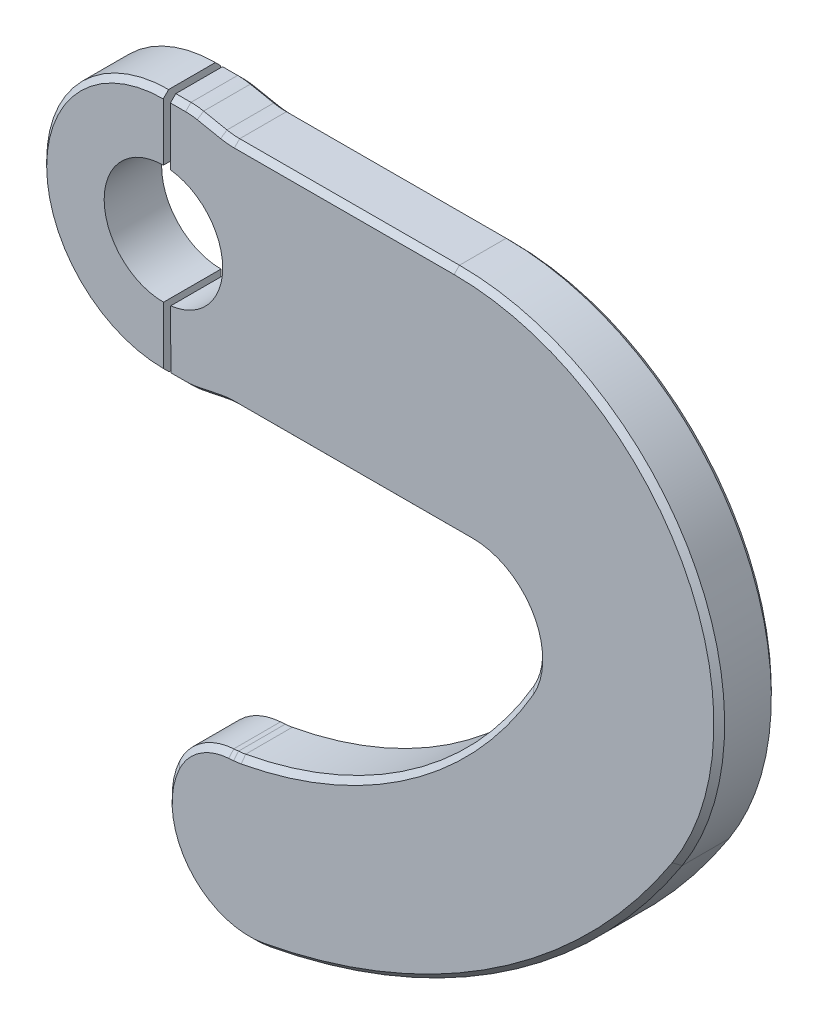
ISO-10303-21;
HEADER;
FILE_DESCRIPTION(('STEP AP214'),'2;1');
FILE_NAME('part.step','',(''),(''),'','','');
FILE_SCHEMA(('AUTOMOTIVE_DESIGN { 1 0 10303 214 1 1 1 1 }'));
ENDSEC;
DATA;
#1=APPLICATION_CONTEXT('core data for automotive mechanical design processes');
#2=APPLICATION_PROTOCOL_DEFINITION('international standard','automotive_design',2000,#1);
#3=PRODUCT_CONTEXT('',#1,'mechanical');
#4=PRODUCT('Part','Part','',(#3));
#5=PRODUCT_RELATED_PRODUCT_CATEGORY('part','',(#4));
#6=PRODUCT_DEFINITION_FORMATION('','',#4);
#7=PRODUCT_DEFINITION_CONTEXT('part definition',#1,'design');
#8=PRODUCT_DEFINITION('design','',#6,#7);
#9=PRODUCT_DEFINITION_SHAPE('','',#8);
#10=(LENGTH_UNIT() NAMED_UNIT(*) SI_UNIT(.MILLI.,.METRE.));
#11=(NAMED_UNIT(*) PLANE_ANGLE_UNIT() SI_UNIT($,.RADIAN.));
#12=(NAMED_UNIT(*) SI_UNIT($,.STERADIAN.) SOLID_ANGLE_UNIT());
#13=UNCERTAINTY_MEASURE_WITH_UNIT(LENGTH_MEASURE(1.E-05),#10,'distance_accuracy_value','');
#14=(GEOMETRIC_REPRESENTATION_CONTEXT(3) GLOBAL_UNCERTAINTY_ASSIGNED_CONTEXT((#13)) GLOBAL_UNIT_ASSIGNED_CONTEXT((#10,
#11,#12)) REPRESENTATION_CONTEXT('',''));
#15=CARTESIAN_POINT('',(0.,0.,0.));
#16=DIRECTION('',(0.,0.,1.));
#17=DIRECTION('',(1.,0.,0.));
#18=AXIS2_PLACEMENT_3D('',#15,#16,#17);
#19=CARTESIAN_POINT('',(0.,0.,8.));
#20=DIRECTION('',(0.,0.,-1.));
#21=DIRECTION('',(-0.978326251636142,0.207069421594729,0.));
#22=AXIS2_PLACEMENT_3D('',#19,#20,#21);
#23=PLANE('',#22);
#24=DIRECTION('',(0.0014957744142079,-0.999998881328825,0.));
#25=VECTOR('',#24,1.);
#26=CARTESIAN_POINT('',(1.99999776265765,0.00299154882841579,8.));
#27=LINE('',#26,#25);
#28=CARTESIAN_POINT('',(2.02449606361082,-16.3753294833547,8.));
#29=VERTEX_POINT('',#28);
#30=CARTESIAN_POINT('',(2.04861043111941,-32.4969720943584,8.));
#31=VERTEX_POINT('',#30);
#32=EDGE_CURVE('E432',#29,#31,#27,.T.);
#33=ORIENTED_EDGE('',*,*,#32,.T.);
#34=DIRECTION('',(0.999998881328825,0.00149577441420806,0.));
#35=VECTOR('',#34,1.);
#36=CARTESIAN_POINT('',(0.0486126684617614,-32.4999636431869,8.));
#37=LINE('',#36,#35);
#38=CARTESIAN_POINT('',(6.26625446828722,-32.490663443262,8.));
#39=VERTEX_POINT('',#38);
#40=EDGE_CURVE('E579',#31,#39,#37,.T.);
#41=ORIENTED_EDGE('',*,*,#40,.T.);
#42=CARTESIAN_POINT('',(6.24157419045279,-15.9906819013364,8.));
#43=DIRECTION('',(0.,0.,-1.));
#44=DIRECTION('',(-0.978326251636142,0.207069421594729,0.));
#45=AXIS2_PLACEMENT_3D('',#42,#43,#44);
#46=CIRCLE('',#45,16.5);
#47=CARTESIAN_POINT('',(9.50168780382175,-32.1654047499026,8.));
#48=VERTEX_POINT('',#47);
#49=EDGE_CURVE('E573',#39,#48,#46,.F.);
#50=ORIENTED_EDGE('',*,*,#49,.T.);
#51=DIRECTION('',(0.980286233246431,0.197582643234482,0.));
#52=VECTOR('',#51,1.);
#53=CARTESIAN_POINT('',(6.6009737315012,-32.750061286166,8.));
#54=LINE('',#53,#52);
#55=CARTESIAN_POINT('',(16.0042562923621,-30.8547725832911,8.));
#56=VERTEX_POINT('',#55);
#57=EDGE_CURVE('E566',#48,#56,#54,.T.);
#58=ORIENTED_EDGE('',*,*,#57,.T.);
#59=CARTESIAN_POINT('',(19.8571178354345,-49.9703541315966,8.));
#60=DIRECTION('',(0.,0.,-1.));
#61=DIRECTION('',(-0.978326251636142,0.207069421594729,0.));
#62=AXIS2_PLACEMENT_3D('',#59,#60,#61);
#63=CIRCLE('',#62,19.5);
#64=CARTESIAN_POINT('',(19.8279502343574,-30.4703759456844,8.));
#65=VERTEX_POINT('',#64);
#66=EDGE_CURVE('E560',#56,#65,#63,.T.);
#67=ORIENTED_EDGE('',*,*,#66,.T.);
#68=DIRECTION('',(0.999998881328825,0.00149577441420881,0.));
#69=VECTOR('',#68,1.);
#70=CARTESIAN_POINT('',(0.0456211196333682,-30.4999658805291,8.));
#71=LINE('',#70,#69);
#72=CARTESIAN_POINT('',(86.0702306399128,-30.371292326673,8.00000000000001));
#73=VERTEX_POINT('',#72);
#74=EDGE_CURVE('E557',#65,#73,#71,.T.);
#75=ORIENTED_EDGE('',*,*,#74,.T.);
#76=CARTESIAN_POINT('',(86.0993982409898,-49.8712705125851,8.00000000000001));
#77=DIRECTION('',(0.,0.,-1.));
#78=DIRECTION('',(-0.978326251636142,0.207069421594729,0.));
#79=AXIS2_PLACEMENT_3D('',#76,#77,#78);
#80=CIRCLE('',#79,19.5);
#81=CARTESIAN_POINT('',(102.973149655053,-59.6450370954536,8.00000000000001));
#82=VERTEX_POINT('',#81);
#83=EDGE_CURVE('E554',#73,#82,#80,.T.);
#84=ORIENTED_EDGE('',*,*,#83,.T.);
#85=CARTESIAN_POINT('',(0.,0.,8.));
#86=DIRECTION('',(0.,0.,-1.));
#87=DIRECTION('',(-0.978326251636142,0.207069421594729,0.));
#88=AXIS2_PLACEMENT_3D('',#85,#86,#87);
#89=CIRCLE('',#88,119.);
#90=CARTESIAN_POINT('',(21.6604855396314,-117.012065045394,8.));
#91=VERTEX_POINT('',#90);
#92=EDGE_CURVE('E551',#82,#91,#89,.T.);
#93=ORIENTED_EDGE('',*,*,#92,.T.);
#94=CARTESIAN_POINT('',(18.1110782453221,-97.837819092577,8.));
#95=DIRECTION('',(0.,0.,-1.));
#96=DIRECTION('',(-0.978326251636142,0.207069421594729,0.));
#97=AXIS2_PLACEMENT_3D('',#94,#95,#96);
#98=CIRCLE('',#97,19.5);
#99=CARTESIAN_POINT('',(19.5132875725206,-117.28733859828,8.));
#100=VERTEX_POINT('',#99);
#101=EDGE_CURVE('E548',#91,#100,#98,.T.);
#102=ORIENTED_EDGE('',*,*,#101,.T.);
#103=DIRECTION('',(-0.997411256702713,-0.071908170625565,0.));
#104=VECTOR('',#103,1.);
#105=CARTESIAN_POINT('',(8.51298372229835,-118.080403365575,8.));
#106=LINE('',#105,#104);
#107=CARTESIAN_POINT('',(18.2037699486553,-117.381748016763,8.));
#108=VERTEX_POINT('',#107);
#109=EDGE_CURVE('E545',#100,#108,#106,.T.);
#110=ORIENTED_EDGE('',*,*,#109,.T.);
#111=CARTESIAN_POINT('',(19.3902547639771,-133.839033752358,8.));
#112=DIRECTION('',(0.,0.,-1.));
#113=DIRECTION('',(-0.978326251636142,0.207069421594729,0.));
#114=AXIS2_PLACEMENT_3D('',#111,#112,#113);
#115=CIRCLE('',#114,16.5);
#116=CARTESIAN_POINT('',(4.43696355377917,-126.864144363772,8.));
#117=VERTEX_POINT('',#116);
#118=EDGE_CURVE('E542',#108,#117,#115,.F.);
#119=ORIENTED_EDGE('',*,*,#118,.T.);
#120=CARTESIAN_POINT('',(23.9215551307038,-135.952636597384,8.));
#121=DIRECTION('',(0.,0.,-1.));
#122=DIRECTION('',(-0.978326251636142,0.207069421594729,0.));
#123=AXIS2_PLACEMENT_3D('',#120,#121,#122);
#124=CIRCLE('',#123,21.4999999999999);
#125=CARTESIAN_POINT('',(27.8697048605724,-157.087018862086,8.));
#126=VERTEX_POINT('',#125);
#127=EDGE_CURVE('E539',#117,#126,#124,.F.);
#128=ORIENTED_EDGE('',*,*,#127,.T.);
#129=CARTESIAN_POINT('',(-3.99094528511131,13.4625310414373,8.));
#130=DIRECTION('',(0.,0.,-1.));
#131=DIRECTION('',(-0.978326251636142,0.207069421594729,0.));
#132=AXIS2_PLACEMENT_3D('',#129,#130,#131);
#133=CIRCLE('',#132,173.5);
#134=CARTESIAN_POINT('',(141.647587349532,-80.8331094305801,8.00000000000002));
#135=VERTEX_POINT('',#134);
#136=EDGE_CURVE('E536',#126,#135,#133,.F.);
#137=ORIENTED_EDGE('',*,*,#136,.T.);
#138=CARTESIAN_POINT('',(81.0340667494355,-41.5880645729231,8.00000000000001));
#139=DIRECTION('',(0.,0.,-1.));
#140=DIRECTION('',(-0.978326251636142,0.207069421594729,0.));
#141=AXIS2_PLACEMENT_3D('',#138,#139,#140);
#142=CIRCLE('',#141,72.2092267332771);
#143=CARTESIAN_POINT('',(80.926058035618,30.6210813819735,8.00000000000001));
#144=VERTEX_POINT('',#143);
#145=EDGE_CURVE('E530',#135,#144,#142,.F.);
#146=ORIENTED_EDGE('',*,*,#145,.T.);
#147=DIRECTION('',(-0.999998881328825,-0.00149577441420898,0.));
#148=VECTOR('',#147,1.);
#149=CARTESIAN_POINT('',(19.7367079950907,30.5295558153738,8.));
#150=LINE('',#149,#148);
#151=CARTESIAN_POINT('',(19.7367079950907,30.5295558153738,8.));
#152=VERTEX_POINT('',#151);
#153=EDGE_CURVE('E527',#144,#152,#150,.T.);
#154=ORIENTED_EDGE('',*,*,#153,.T.);
#155=CARTESIAN_POINT('',(19.7075403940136,50.0295340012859,8.));
#156=DIRECTION('',(0.,0.,-1.));
#157=DIRECTION('',(-0.978326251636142,0.207069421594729,0.));
#158=AXIS2_PLACEMENT_3D('',#155,#156,#157);
#159=CIRCLE('',#158,19.5);
#160=CARTESIAN_POINT('',(15.9118812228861,30.9025119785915,8.));
#161=VERTEX_POINT('',#160);
#162=EDGE_CURVE('E533',#152,#161,#159,.T.);
#163=ORIENTED_EDGE('',*,*,#162,.T.);
#164=DIRECTION('',(-0.980872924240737,0.194649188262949,0.));
#165=VECTOR('',#164,1.);
#166=CARTESIAN_POINT('',(6.50297089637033,32.7696618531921,8.));
#167=LINE('',#166,#165);
#168=CARTESIAN_POINT('',(9.40542101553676,32.1936855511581,8.));
#169=VERTEX_POINT('',#168);
#170=EDGE_CURVE('E563',#161,#169,#167,.T.);
#171=ORIENTED_EDGE('',*,*,#170,.T.);
#172=CARTESIAN_POINT('',(6.19370940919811,16.009282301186,8.));
#173=DIRECTION('',(0.,0.,-1.));
#174=DIRECTION('',(-0.978326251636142,0.207069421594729,0.));
#175=AXIS2_PLACEMENT_3D('',#172,#173,#174);
#176=CIRCLE('',#175,16.5);
#177=CARTESIAN_POINT('',(6.16902913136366,32.5092638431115,8.));
#178=VERTEX_POINT('',#177);
#179=EDGE_CURVE('E570',#169,#178,#176,.F.);
#180=ORIENTED_EDGE('',*,*,#179,.T.);
#181=DIRECTION('',(-0.999998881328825,-0.00149577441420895,0.));
#182=VECTOR('',#181,1.);
#183=CARTESIAN_POINT('',(1.9513850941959,32.5029551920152,8.));
#184=LINE('',#183,#182);
#185=CARTESIAN_POINT('',(1.95138509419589,32.5029551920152,8.));
#186=VERTEX_POINT('',#185);
#187=EDGE_CURVE('E576',#178,#186,#184,.T.);
#188=ORIENTED_EDGE('',*,*,#187,.T.);
#189=CARTESIAN_POINT('',(1.97549946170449,16.3813125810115,8.));
#190=VERTEX_POINT('',#189);
#191=EDGE_CURVE('E904',#186,#190,#27,.T.);
#192=ORIENTED_EDGE('',*,*,#191,.T.);
#193=CARTESIAN_POINT('',(0.,0.,8.));
#194=DIRECTION('',(0.,0.,-1.));
#195=DIRECTION('',(-0.978326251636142,0.207069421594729,0.));
#196=AXIS2_PLACEMENT_3D('',#193,#194,#195);
#197=CIRCLE('',#196,16.5);
#198=EDGE_CURVE('E441',#190,#29,#197,.T.);
#199=ORIENTED_EDGE('',*,*,#198,.T.);
#200=EDGE_LOOP('',(#33,#41,#50,#58,#67,#75,#84,#93,#102,#110,#119,#128,#137,#146,#154,#163,#171,
#180,#188,#192,#199));
#201=FACE_BOUND('',#200,.T.);
#202=ADVANCED_FACE('F74',(#201),#23,.F.);
#203=CARTESIAN_POINT('',(6.89734769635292,-34.2204906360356,8.));
#204=DIRECTION('',(-0.197582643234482,0.980286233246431,0.));
#205=DIRECTION('',(0.980286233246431,0.197582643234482,0.));
#206=AXIS2_PLACEMENT_3D('',#203,#204,#205);
#207=PLANE('',#206);
#208=DIRECTION('',(0.,0.,-1.));
#209=VECTOR('',#208,1.);
#210=CARTESIAN_POINT('',(16.3006302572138,-32.3252019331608,8.));
#211=LINE('',#210,#209);
#212=CARTESIAN_POINT('',(16.3006302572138,-32.3252019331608,-6.49999999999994));
#213=VERTEX_POINT('',#212);
#214=CARTESIAN_POINT('',(16.3006302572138,-32.3252019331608,6.49999999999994));
#215=VERTEX_POINT('',#214);
#216=EDGE_CURVE('E492',#213,#215,#211,.F.);
#217=ORIENTED_EDGE('',*,*,#216,.T.);
#218=DIRECTION('',(-0.980286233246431,-0.197582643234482,0.));
#219=VECTOR('',#218,1.);
#220=CARTESIAN_POINT('',(6.89734769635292,-34.2204906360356,6.50000000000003));
#221=LINE('',#220,#219);
#222=CARTESIAN_POINT('',(9.79806176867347,-33.6358340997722,6.49999999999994));
#223=VERTEX_POINT('',#222);
#224=EDGE_CURVE('E586',#215,#223,#221,.T.);
#225=ORIENTED_EDGE('',*,*,#224,.T.);
#226=DIRECTION('',(0.,0.,-1.));
#227=VECTOR('',#226,1.);
#228=CARTESIAN_POINT('',(9.79806176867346,-33.6358340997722,8.));
#229=LINE('',#228,#227);
#230=CARTESIAN_POINT('',(9.79806176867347,-33.6358340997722,-6.49999999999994));
#231=VERTEX_POINT('',#230);
#232=EDGE_CURVE('E496',#223,#231,#229,.T.);
#233=ORIENTED_EDGE('',*,*,#232,.T.);
#234=DIRECTION('',(0.980286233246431,0.197582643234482,0.));
#235=VECTOR('',#234,1.);
#236=CARTESIAN_POINT('',(16.3006302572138,-32.3252019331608,-6.49999999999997));
#237=LINE('',#236,#235);
#238=EDGE_CURVE('E582',#231,#213,#237,.T.);
#239=ORIENTED_EDGE('',*,*,#238,.T.);
#240=EDGE_LOOP('',(#217,#225,#233,#239));
#241=FACE_BOUND('',#240,.T.);
#242=ADVANCED_FACE('F1103',(#241),#207,.F.);
#243=CARTESIAN_POINT('',(0.0478647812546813,-31.9999642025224,8.));
#244=DIRECTION('',(-0.00149577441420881,0.999998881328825,0.));
#245=DIRECTION('',(0.999998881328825,0.00149577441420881,0.));
#246=AXIS2_PLACEMENT_3D('',#243,#244,#245);
#247=PLANE('',#246);
#248=DIRECTION('',(0.,0.,-1.));
#249=VECTOR('',#248,1.);
#250=CARTESIAN_POINT('',(86.0724743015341,-31.8712906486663,8.00000000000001));
#251=LINE('',#250,#249);
#252=CARTESIAN_POINT('',(86.0724743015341,-31.8712906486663,6.49999999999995));
#253=VERTEX_POINT('',#252);
#254=CARTESIAN_POINT('',(86.0724743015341,-31.8712906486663,-6.49999999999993));
#255=VERTEX_POINT('',#254);
#256=EDGE_CURVE('E462',#253,#255,#251,.T.);
#257=ORIENTED_EDGE('',*,*,#256,.F.);
#258=DIRECTION('',(-0.999998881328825,-0.00149577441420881,0.));
#259=VECTOR('',#258,1.);
#260=CARTESIAN_POINT('',(0.0478647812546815,-31.9999642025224,6.49999999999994));
#261=LINE('',#260,#259);
#262=CARTESIAN_POINT('',(19.8301938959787,-31.9703742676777,6.49999999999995));
#263=VERTEX_POINT('',#262);
#264=EDGE_CURVE('E686',#253,#263,#261,.T.);
#265=ORIENTED_EDGE('',*,*,#264,.T.);
#266=DIRECTION('',(0.,0.,-1.));
#267=VECTOR('',#266,1.);
#268=CARTESIAN_POINT('',(19.8301938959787,-31.9703742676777,-8.));
#269=LINE('',#268,#267);
#270=CARTESIAN_POINT('',(19.8301938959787,-31.9703742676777,-6.49999999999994));
#271=VERTEX_POINT('',#270);
#272=EDGE_CURVE('E504',#263,#271,#269,.T.);
#273=ORIENTED_EDGE('',*,*,#272,.T.);
#274=DIRECTION('',(0.999998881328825,0.00149577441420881,0.));
#275=VECTOR('',#274,1.);
#276=CARTESIAN_POINT('',(86.0724743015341,-31.8712906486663,-6.49999999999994));
#277=LINE('',#276,#275);
#278=EDGE_CURVE('E683',#271,#255,#277,.T.);
#279=ORIENTED_EDGE('',*,*,#278,.T.);
#280=EDGE_LOOP('',(#257,#265,#273,#279));
#281=FACE_BOUND('',#280,.T.);
#282=ADVANCED_FACE('F1110',(#281),#247,.F.);
#283=CARTESIAN_POINT('',(86.0993982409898,-49.8712705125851,8.00000000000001));
#284=DIRECTION('',(0.,0.,-1.));
#285=DIRECTION('',(-0.978326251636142,0.207069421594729,0.));
#286=AXIS2_PLACEMENT_3D('',#283,#284,#285);
#287=CYLINDRICAL_SURFACE('',#286,18.);
#288=DIRECTION('',(0.,0.,-1.));
#289=VECTOR('',#288,1.);
#290=CARTESIAN_POINT('',(101.675168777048,-58.8932088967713,8.00000000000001));
#291=LINE('',#290,#289);
#292=CARTESIAN_POINT('',(101.675168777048,-58.8932088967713,6.49999999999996));
#293=VERTEX_POINT('',#292);
#294=CARTESIAN_POINT('',(101.675168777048,-58.8932088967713,-6.49999999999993));
#295=VERTEX_POINT('',#294);
#296=EDGE_CURVE('E466',#293,#295,#291,.T.);
#297=ORIENTED_EDGE('',*,*,#296,.F.);
#298=CARTESIAN_POINT('',(86.0993982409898,-49.8712705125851,6.49999999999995));
#299=DIRECTION('',(0.,0.,-1.));
#300=DIRECTION('',(-0.978326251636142,0.207069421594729,0.));
#301=AXIS2_PLACEMENT_3D('',#298,#299,#300);
#302=CIRCLE('',#301,18.);
#303=EDGE_CURVE('E692',#293,#253,#302,.F.);
#304=ORIENTED_EDGE('',*,*,#303,.T.);
#305=ORIENTED_EDGE('',*,*,#256,.T.);
#306=CARTESIAN_POINT('',(86.0993982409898,-49.8712705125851,-6.49999999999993));
#307=DIRECTION('',(0.,0.,-1.));
#308=DIRECTION('',(-0.978326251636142,0.207069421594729,0.));
#309=AXIS2_PLACEMENT_3D('',#306,#307,#308);
#310=CIRCLE('',#309,18.);
#311=EDGE_CURVE('E689',#255,#295,#310,.T.);
#312=ORIENTED_EDGE('',*,*,#311,.T.);
#313=EDGE_LOOP('',(#297,#304,#305,#312));
#314=FACE_BOUND('',#313,.T.);
#315=ADVANCED_FACE('F1113',(#314),#287,.F.);
#316=CARTESIAN_POINT('',(0.,0.,8.));
#317=DIRECTION('',(0.,0.,-1.));
#318=DIRECTION('',(-0.978326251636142,0.207069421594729,0.));
#319=AXIS2_PLACEMENT_3D('',#316,#317,#318);
#320=CYLINDRICAL_SURFACE('',#319,117.5);
#321=DIRECTION('',(0.,0.,-1.));
#322=VECTOR('',#321,1.);
#323=CARTESIAN_POINT('',(21.3874542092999,-115.537123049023,8.));
#324=LINE('',#323,#322);
#325=CARTESIAN_POINT('',(21.3874542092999,-115.537123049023,-6.49999999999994));
#326=VERTEX_POINT('',#325);
#327=CARTESIAN_POINT('',(21.3874542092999,-115.537123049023,6.49999999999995));
#328=VERTEX_POINT('',#327);
#329=EDGE_CURVE('E523',#326,#328,#324,.F.);
#330=ORIENTED_EDGE('',*,*,#329,.T.);
#331=CARTESIAN_POINT('',(0.,0.,6.49999999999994));
#332=DIRECTION('',(0.,0.,-1.));
#333=DIRECTION('',(-0.978326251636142,0.207069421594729,0.));
#334=AXIS2_PLACEMENT_3D('',#331,#332,#333);
#335=CIRCLE('',#334,117.5);
#336=EDGE_CURVE('E698',#328,#293,#335,.F.);
#337=ORIENTED_EDGE('',*,*,#336,.T.);
#338=ORIENTED_EDGE('',*,*,#296,.T.);
#339=CARTESIAN_POINT('',(0.,0.,-6.49999999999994));
#340=DIRECTION('',(0.,0.,-1.));
#341=DIRECTION('',(-0.978326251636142,0.207069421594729,0.));
#342=AXIS2_PLACEMENT_3D('',#339,#340,#341);
#343=CIRCLE('',#342,117.5);
#344=EDGE_CURVE('E695',#295,#326,#343,.T.);
#345=ORIENTED_EDGE('',*,*,#344,.T.);
#346=EDGE_LOOP('',(#330,#337,#338,#345));
#347=FACE_BOUND('',#346,.T.);
#348=ADVANCED_FACE('F1115',(#347),#320,.F.);
#349=CARTESIAN_POINT('',(8.40512146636,-116.584286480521,8.));
#350=DIRECTION('',(0.071908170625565,-0.997411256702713,0.));
#351=DIRECTION('',(-0.997411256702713,-0.071908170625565,0.));
#352=AXIS2_PLACEMENT_3D('',#349,#350,#351);
#353=PLANE('',#352);
#354=DIRECTION('',(0.,0.,1.));
#355=VECTOR('',#354,1.);
#356=CARTESIAN_POINT('',(18.095907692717,-115.885631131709,8.));
#357=LINE('',#356,#355);
#358=CARTESIAN_POINT('',(18.095907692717,-115.885631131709,-6.49999999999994));
#359=VERTEX_POINT('',#358);
#360=CARTESIAN_POINT('',(18.095907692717,-115.885631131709,6.49999999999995));
#361=VERTEX_POINT('',#360);
#362=EDGE_CURVE('E519',#359,#361,#357,.T.);
#363=ORIENTED_EDGE('',*,*,#362,.T.);
#364=DIRECTION('',(0.997411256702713,0.071908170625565,0.));
#365=VECTOR('',#364,1.);
#366=CARTESIAN_POINT('',(8.40512146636,-116.584286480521,6.49999999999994));
#367=LINE('',#366,#365);
#368=CARTESIAN_POINT('',(19.4054253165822,-115.791221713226,6.49999999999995));
#369=VERTEX_POINT('',#368);
#370=EDGE_CURVE('E710',#361,#369,#367,.T.);
#371=ORIENTED_EDGE('',*,*,#370,.T.);
#372=DIRECTION('',(0.,0.,1.));
#373=VECTOR('',#372,1.);
#374=CARTESIAN_POINT('',(19.4054253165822,-115.791221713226,-8.));
#375=LINE('',#374,#373);
#376=CARTESIAN_POINT('',(19.4054253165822,-115.791221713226,-6.49999999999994));
#377=VERTEX_POINT('',#376);
#378=EDGE_CURVE('E515',#369,#377,#375,.F.);
#379=ORIENTED_EDGE('',*,*,#378,.T.);
#380=DIRECTION('',(-0.997411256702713,-0.071908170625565,0.));
#381=VECTOR('',#380,1.);
#382=CARTESIAN_POINT('',(18.095907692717,-115.885631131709,-6.49999999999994));
#383=LINE('',#382,#381);
#384=EDGE_CURVE('E707',#377,#359,#383,.T.);
#385=ORIENTED_EDGE('',*,*,#384,.T.);
#386=EDGE_LOOP('',(#363,#371,#379,#385));
#387=FACE_BOUND('',#386,.T.);
#388=ADVANCED_FACE('F1121',(#387),#353,.F.);
#389=CARTESIAN_POINT('',(23.9215551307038,-135.952636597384,8.));
#390=DIRECTION('',(0.,0.,-1.));
#391=DIRECTION('',(-0.978326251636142,0.207069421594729,0.));
#392=AXIS2_PLACEMENT_3D('',#389,#390,#391);
#393=CYLINDRICAL_SURFACE('',#392,23.);
#394=DIRECTION('',(0.,0.,-1.));
#395=VECTOR('',#394,1.);
#396=CARTESIAN_POINT('',(28.1451571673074,-158.561510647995,8.));
#397=LINE('',#396,#395);
#398=CARTESIAN_POINT('',(28.1451571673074,-158.561510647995,6.49999999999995));
#399=VERTEX_POINT('',#398);
#400=CARTESIAN_POINT('',(28.1451571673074,-158.561510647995,-6.49999999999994));
#401=VERTEX_POINT('',#400);
#402=EDGE_CURVE('E470',#399,#401,#397,.T.);
#403=ORIENTED_EDGE('',*,*,#402,.F.);
#404=CARTESIAN_POINT('',(23.9215551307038,-135.952636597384,6.49999999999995));
#405=DIRECTION('',(0.,0.,-1.));
#406=DIRECTION('',(-0.978326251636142,0.207069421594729,0.));
#407=AXIS2_PLACEMENT_3D('',#404,#405,#406);
#408=CIRCLE('',#407,23.);
#409=CARTESIAN_POINT('',(3.07757344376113,-126.230063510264,6.49999999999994));
#410=VERTEX_POINT('',#409);
#411=EDGE_CURVE('E728',#399,#410,#408,.T.);
#412=ORIENTED_EDGE('',*,*,#411,.T.);
#413=DIRECTION('',(0.,0.,-1.));
#414=VECTOR('',#413,1.);
#415=CARTESIAN_POINT('',(3.07757344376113,-126.230063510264,8.));
#416=LINE('',#415,#414);
#417=CARTESIAN_POINT('',(3.07757344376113,-126.230063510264,-6.49999999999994));
#418=VERTEX_POINT('',#417);
#419=EDGE_CURVE('E511',#410,#418,#416,.T.);
#420=ORIENTED_EDGE('',*,*,#419,.T.);
#421=CARTESIAN_POINT('',(23.9215551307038,-135.952636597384,-6.49999999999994));
#422=DIRECTION('',(0.,0.,-1.));
#423=DIRECTION('',(-0.978326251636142,0.207069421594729,0.));
#424=AXIS2_PLACEMENT_3D('',#421,#422,#423);
#425=CIRCLE('',#424,23.);
#426=EDGE_CURVE('E725',#418,#401,#425,.F.);
#427=ORIENTED_EDGE('',*,*,#426,.T.);
#428=EDGE_LOOP('',(#403,#412,#420,#427));
#429=FACE_BOUND('',#428,.T.);
#430=ADVANCED_FACE('F1128',(#429),#393,.T.);
#431=CARTESIAN_POINT('',(-3.99094528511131,13.4625310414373,8.));
#432=DIRECTION('',(0.,0.,-1.));
#433=DIRECTION('',(-0.978326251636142,0.207069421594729,0.));
#434=AXIS2_PLACEMENT_3D('',#431,#432,#433);
#435=CYLINDRICAL_SURFACE('',#434,175.);
#436=DIRECTION('',(0.,0.,-1.));
#437=VECTOR('',#436,1.);
#438=CARTESIAN_POINT('',(142.906710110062,-81.6483455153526,8.00000000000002));
#439=LINE('',#438,#437);
#440=CARTESIAN_POINT('',(142.906710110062,-81.6483455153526,6.49999999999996));
#441=VERTEX_POINT('',#440);
#442=CARTESIAN_POINT('',(142.906710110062,-81.6483455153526,-6.49999999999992));
#443=VERTEX_POINT('',#442);
#444=EDGE_CURVE('E474',#441,#443,#439,.T.);
#445=ORIENTED_EDGE('',*,*,#444,.F.);
#446=CARTESIAN_POINT('',(-3.99094528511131,13.4625310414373,6.49999999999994));
#447=DIRECTION('',(0.,0.,-1.));
#448=DIRECTION('',(-0.978326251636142,0.207069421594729,0.));
#449=AXIS2_PLACEMENT_3D('',#446,#447,#448);
#450=CIRCLE('',#449,175.);
#451=EDGE_CURVE('E734',#441,#399,#450,.T.);
#452=ORIENTED_EDGE('',*,*,#451,.T.);
#453=ORIENTED_EDGE('',*,*,#402,.T.);
#454=CARTESIAN_POINT('',(-3.9909452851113,13.4625310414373,-6.49999999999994));
#455=DIRECTION('',(0.,0.,-1.));
#456=DIRECTION('',(-0.978326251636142,0.207069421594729,0.));
#457=AXIS2_PLACEMENT_3D('',#454,#455,#456);
#458=CIRCLE('',#457,175.);
#459=EDGE_CURVE('E731',#401,#443,#458,.F.);
#460=ORIENTED_EDGE('',*,*,#459,.T.);
#461=EDGE_LOOP('',(#445,#452,#453,#460));
#462=FACE_BOUND('',#461,.T.);
#463=ADVANCED_FACE('F1131',(#462),#435,.T.);
#464=CARTESIAN_POINT('',(81.0340667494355,-41.5880645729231,8.00000000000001));
#465=DIRECTION('',(0.,0.,-1.));
#466=DIRECTION('',(-0.978326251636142,0.207069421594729,0.));
#467=AXIS2_PLACEMENT_3D('',#464,#465,#466);
#468=CYLINDRICAL_SURFACE('',#467,73.7092267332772);
#469=DIRECTION('',(0.,0.,-1.));
#470=VECTOR('',#469,1.);
#471=CARTESIAN_POINT('',(80.9238143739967,32.1210797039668,8.00000000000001));
#472=LINE('',#471,#470);
#473=CARTESIAN_POINT('',(80.9238143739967,32.1210797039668,6.49999999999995));
#474=VERTEX_POINT('',#473);
#475=CARTESIAN_POINT('',(80.9238143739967,32.1210797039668,-6.49999999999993));
#476=VERTEX_POINT('',#475);
#477=EDGE_CURVE('E457',#474,#476,#472,.T.);
#478=ORIENTED_EDGE('',*,*,#477,.F.);
#479=CARTESIAN_POINT('',(81.0340667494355,-41.5880645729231,6.49999999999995));
#480=DIRECTION('',(0.,0.,-1.));
#481=DIRECTION('',(-0.978326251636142,0.207069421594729,0.));
#482=AXIS2_PLACEMENT_3D('',#479,#480,#481);
#483=CIRCLE('',#482,73.7092267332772);
#484=EDGE_CURVE('E745',#474,#441,#483,.T.);
#485=ORIENTED_EDGE('',*,*,#484,.T.);
#486=ORIENTED_EDGE('',*,*,#444,.T.);
#487=CARTESIAN_POINT('',(81.0340667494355,-41.5880645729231,-6.49999999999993));
#488=DIRECTION('',(0.,0.,-1.));
#489=DIRECTION('',(-0.978326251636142,0.207069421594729,0.));
#490=AXIS2_PLACEMENT_3D('',#487,#488,#489);
#491=CIRCLE('',#490,73.7092267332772);
#492=EDGE_CURVE('E96',#443,#476,#491,.F.);
#493=ORIENTED_EDGE('',*,*,#492,.T.);
#494=EDGE_LOOP('',(#478,#485,#486,#493));
#495=FACE_BOUND('',#494,.T.);
#496=ADVANCED_FACE('F1132',(#495),#468,.T.);
#497=CARTESIAN_POINT('',(-0.0478647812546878,31.9999642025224,8.));
#498=DIRECTION('',(-0.00149577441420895,0.999998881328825,0.));
#499=DIRECTION('',(0.999998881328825,0.00149577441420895,0.));
#500=AXIS2_PLACEMENT_3D('',#497,#498,#499);
#501=PLANE('',#500);
#502=DIRECTION('',(0.,0.,-1.));
#503=VECTOR('',#502,1.);
#504=CARTESIAN_POINT('',(19.7344643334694,32.0295541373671,8.));
#505=LINE('',#504,#503);
#506=CARTESIAN_POINT('',(19.7344643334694,32.0295541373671,-6.49999999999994));
#507=VERTEX_POINT('',#506);
#508=CARTESIAN_POINT('',(19.7344643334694,32.0295541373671,6.49999999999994));
#509=VERTEX_POINT('',#508);
#510=EDGE_CURVE('E508',#507,#509,#505,.F.);
#511=ORIENTED_EDGE('',*,*,#510,.T.);
#512=DIRECTION('',(0.999998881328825,0.00149577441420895,0.));
#513=VECTOR('',#512,1.);
#514=CARTESIAN_POINT('',(80.9238143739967,32.1210797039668,6.49999999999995));
#515=LINE('',#514,#513);
#516=EDGE_CURVE('E13',#509,#474,#515,.T.);
#517=ORIENTED_EDGE('',*,*,#516,.T.);
#518=ORIENTED_EDGE('',*,*,#477,.T.);
#519=DIRECTION('',(-0.999998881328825,-0.00149577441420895,0.));
#520=VECTOR('',#519,1.);
#521=CARTESIAN_POINT('',(-0.0478647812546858,31.9999642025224,-6.49999999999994));
#522=LINE('',#521,#520);
#523=EDGE_CURVE('E84',#476,#507,#522,.T.);
#524=ORIENTED_EDGE('',*,*,#523,.T.);
#525=EDGE_LOOP('',(#511,#517,#518,#524));
#526=FACE_BOUND('',#525,.T.);
#527=ADVANCED_FACE('F1133',(#526),#501,.T.);
#528=CARTESIAN_POINT('',(6.79494467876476,34.2409712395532,8.));
#529=DIRECTION('',(-0.194649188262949,-0.980872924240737,0.));
#530=DIRECTION('',(-0.980872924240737,0.194649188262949,0.));
#531=AXIS2_PLACEMENT_3D('',#528,#529,#530);
#532=PLANE('',#531);
#533=DIRECTION('',(0.,0.,-1.));
#534=VECTOR('',#533,1.);
#535=CARTESIAN_POINT('',(16.2038550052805,32.3738213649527,8.));
#536=LINE('',#535,#534);
#537=CARTESIAN_POINT('',(16.2038550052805,32.3738213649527,6.49999999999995));
#538=VERTEX_POINT('',#537);
#539=CARTESIAN_POINT('',(16.2038550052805,32.3738213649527,-6.49999999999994));
#540=VERTEX_POINT('',#539);
#541=EDGE_CURVE('E484',#538,#540,#536,.T.);
#542=ORIENTED_EDGE('',*,*,#541,.T.);
#543=DIRECTION('',(-0.980872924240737,0.194649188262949,0.));
#544=VECTOR('',#543,1.);
#545=CARTESIAN_POINT('',(9.69739479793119,33.6649949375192,-6.50000000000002));
#546=LINE('',#545,#544);
#547=CARTESIAN_POINT('',(9.69739479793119,33.6649949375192,-6.49999999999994));
#548=VERTEX_POINT('',#547);
#549=EDGE_CURVE('E668',#540,#548,#546,.T.);
#550=ORIENTED_EDGE('',*,*,#549,.T.);
#551=DIRECTION('',(0.,0.,-1.));
#552=VECTOR('',#551,1.);
#553=CARTESIAN_POINT('',(9.69739479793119,33.6649949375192,8.));
#554=LINE('',#553,#552);
#555=CARTESIAN_POINT('',(9.69739479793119,33.6649949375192,6.49999999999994));
#556=VERTEX_POINT('',#555);
#557=EDGE_CURVE('E488',#548,#556,#554,.F.);
#558=ORIENTED_EDGE('',*,*,#557,.T.);
#559=DIRECTION('',(0.980872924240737,-0.194649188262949,0.));
#560=VECTOR('',#559,1.);
#561=CARTESIAN_POINT('',(6.79494467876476,34.2409712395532,6.5));
#562=LINE('',#561,#560);
#563=EDGE_CURVE('E665',#556,#538,#562,.T.);
#564=ORIENTED_EDGE('',*,*,#563,.T.);
#565=EDGE_LOOP('',(#542,#550,#558,#564));
#566=FACE_BOUND('',#565,.T.);
#567=ADVANCED_FACE('F1016',(#566),#532,.F.);
#568=CARTESIAN_POINT('',(-0.0508563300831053,33.9999619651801,8.));
#569=DIRECTION('',(-0.00149577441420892,0.999998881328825,0.));
#570=DIRECTION('',(0.999998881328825,0.00149577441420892,0.));
#571=AXIS2_PLACEMENT_3D('',#568,#569,#570);
#572=PLANE('',#571);
#573=DIRECTION('',(0.,0.,-1.));
#574=VECTOR('',#573,1.);
#575=CARTESIAN_POINT('',(6.16678546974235,34.0092621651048,-8.));
#576=LINE('',#575,#574);
#577=CARTESIAN_POINT('',(6.16678546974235,34.0092621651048,6.49999999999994));
#578=VERTEX_POINT('',#577);
#579=CARTESIAN_POINT('',(6.16678546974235,34.0092621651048,-6.49999999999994));
#580=VERTEX_POINT('',#579);
#581=EDGE_CURVE('E481',#578,#580,#576,.T.);
#582=ORIENTED_EDGE('',*,*,#581,.T.);
#583=DIRECTION('',(-0.999998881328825,-0.00149577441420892,0.));
#584=VECTOR('',#583,1.);
#585=CARTESIAN_POINT('',(-0.0508563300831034,33.9999619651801,-6.49999999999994));
#586=LINE('',#585,#584);
#587=CARTESIAN_POINT('',(1.94914143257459,34.0029535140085,-6.49999999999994));
#588=VERTEX_POINT('',#587);
#589=EDGE_CURVE('E657',#580,#588,#586,.T.);
#590=ORIENTED_EDGE('',*,*,#589,.T.);
#591=DIRECTION('',(0.,0.,-1.));
#592=VECTOR('',#591,1.);
#593=CARTESIAN_POINT('',(1.94914143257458,34.0029535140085,8.));
#594=LINE('',#593,#592);
#595=CARTESIAN_POINT('',(1.94914143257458,34.0029535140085,6.50000000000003));
#596=VERTEX_POINT('',#595);
#597=EDGE_CURVE('E899',#596,#588,#594,.T.);
#598=ORIENTED_EDGE('',*,*,#597,.F.);
#599=DIRECTION('',(0.999998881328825,0.00149577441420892,0.));
#600=VECTOR('',#599,1.);
#601=CARTESIAN_POINT('',(6.16678546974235,34.0092621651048,6.50000000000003));
#602=LINE('',#601,#600);
#603=EDGE_CURVE('E654',#596,#578,#602,.T.);
#604=ORIENTED_EDGE('',*,*,#603,.T.);
#605=EDGE_LOOP('',(#582,#590,#598,#604));
#606=FACE_BOUND('',#605,.T.);
#607=ADVANCED_FACE('F898',(#606),#572,.T.);
#608=CARTESIAN_POINT('',(0.,0.,8.));
#609=DIRECTION('',(0.,0.,-1.));
#610=DIRECTION('',(-0.978326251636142,0.207069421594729,0.));
#611=AXIS2_PLACEMENT_3D('',#608,#609,#610);
#612=CYLINDRICAL_SURFACE('',#611,16.5);
#613=CARTESIAN_POINT('',(0.,0.,-8.));
#614=DIRECTION('',(0.,0.,-1.));
#615=DIRECTION('',(-0.978326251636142,0.207069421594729,0.));
#616=AXIS2_PLACEMENT_3D('',#613,#614,#615);
#617=CIRCLE('',#616,16.5);
#618=CARTESIAN_POINT('',(1.97549946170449,16.3813125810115,-8.));
#619=VERTEX_POINT('',#618);
#620=CARTESIAN_POINT('',(2.02449606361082,-16.3753294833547,-8.));
#621=VERTEX_POINT('',#620);
#622=EDGE_CURVE('E439',#619,#621,#617,.T.);
#623=ORIENTED_EDGE('',*,*,#622,.T.);
#624=DIRECTION('',(0.,0.,-1.));
#625=VECTOR('',#624,1.);
#626=CARTESIAN_POINT('',(2.02449606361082,-16.3753294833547,8.));
#627=LINE('',#626,#625);
#628=EDGE_CURVE('E443',#621,#29,#627,.F.);
#629=ORIENTED_EDGE('',*,*,#628,.T.);
#630=ORIENTED_EDGE('',*,*,#198,.F.);
#631=DIRECTION('',(0.,0.,-1.));
#632=VECTOR('',#631,1.);
#633=CARTESIAN_POINT('',(1.97549946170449,16.3813125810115,8.));
#634=LINE('',#633,#632);
#635=EDGE_CURVE('E424',#190,#619,#634,.T.);
#636=ORIENTED_EDGE('',*,*,#635,.T.);
#637=EDGE_LOOP('',(#623,#629,#630,#636));
#638=FACE_BOUND('',#637,.T.);
#639=ADVANCED_FACE('F437',(#638),#612,.F.);
#640=CARTESIAN_POINT('',(0.0508563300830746,-33.99996196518,8.));
#641=DIRECTION('',(-0.00149577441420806,0.999998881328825,0.));
#642=DIRECTION('',(0.999998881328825,0.00149577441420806,0.));
#643=AXIS2_PLACEMENT_3D('',#640,#641,#642);
#644=PLANE('',#643);
#645=DIRECTION('',(0.,0.,-1.));
#646=VECTOR('',#645,1.);
#647=CARTESIAN_POINT('',(6.26849812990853,-33.9906617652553,8.));
#648=LINE('',#647,#646);
#649=CARTESIAN_POINT('',(6.26849812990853,-33.9906617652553,-6.49999999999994));
#650=VERTEX_POINT('',#649);
#651=CARTESIAN_POINT('',(6.26849812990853,-33.9906617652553,6.49999999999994));
#652=VERTEX_POINT('',#651);
#653=EDGE_CURVE('E500',#650,#652,#648,.F.);
#654=ORIENTED_EDGE('',*,*,#653,.T.);
#655=DIRECTION('',(-0.999998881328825,-0.00149577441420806,0.));
#656=VECTOR('',#655,1.);
#657=CARTESIAN_POINT('',(0.0508563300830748,-33.99996196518,6.50000000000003));
#658=LINE('',#657,#656);
#659=CARTESIAN_POINT('',(2.05085409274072,-33.9969704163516,6.50000000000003));
#660=VERTEX_POINT('',#659);
#661=EDGE_CURVE('E592',#652,#660,#658,.T.);
#662=ORIENTED_EDGE('',*,*,#661,.T.);
#663=DIRECTION('',(0.,0.,-1.));
#664=VECTOR('',#663,1.);
#665=CARTESIAN_POINT('',(2.05085409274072,-33.9969704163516,8.));
#666=LINE('',#665,#664);
#667=CARTESIAN_POINT('',(2.05085409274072,-33.9969704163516,-6.49999999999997));
#668=VERTEX_POINT('',#667);
#669=EDGE_CURVE('E444',#660,#668,#666,.T.);
#670=ORIENTED_EDGE('',*,*,#669,.T.);
#671=DIRECTION('',(0.999998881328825,0.00149577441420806,0.));
#672=VECTOR('',#671,1.);
#673=CARTESIAN_POINT('',(6.26849812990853,-33.9906617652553,-6.49999999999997));
#674=LINE('',#673,#672);
#675=EDGE_CURVE('E589',#668,#650,#674,.T.);
#676=ORIENTED_EDGE('',*,*,#675,.T.);
#677=EDGE_LOOP('',(#654,#662,#670,#676));
#678=FACE_BOUND('',#677,.T.);
#679=ADVANCED_FACE('F1097',(#678),#644,.F.);
#680=CARTESIAN_POINT('',(0.,0.,-8.));
#681=DIRECTION('',(0.,0.,-1.));
#682=DIRECTION('',(-0.978326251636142,0.207069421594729,0.));
#683=AXIS2_PLACEMENT_3D('',#680,#681,#682);
#684=PLANE('',#683);
#685=CARTESIAN_POINT('',(6.24157419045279,-15.9906819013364,-8.));
#686=DIRECTION('',(0.,0.,-1.));
#687=DIRECTION('',(-0.978326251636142,0.207069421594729,0.));
#688=AXIS2_PLACEMENT_3D('',#685,#686,#687);
#689=CIRCLE('',#688,16.5);
#690=CARTESIAN_POINT('',(9.50168780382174,-32.1654047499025,-8.));
#691=VERTEX_POINT('',#690);
#692=CARTESIAN_POINT('',(6.26625446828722,-32.490663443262,-8.));
#693=VERTEX_POINT('',#692);
#694=EDGE_CURVE('E645',#691,#693,#689,.T.);
#695=ORIENTED_EDGE('',*,*,#694,.T.);
#696=DIRECTION('',(-0.999998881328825,-0.00149577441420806,0.));
#697=VECTOR('',#696,1.);
#698=CARTESIAN_POINT('',(2.04861043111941,-32.4969720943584,-8.));
#699=LINE('',#698,#697);
#700=CARTESIAN_POINT('',(2.04861043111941,-32.4969720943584,-8.));
#701=VERTEX_POINT('',#700);
#702=EDGE_CURVE('E651',#693,#701,#699,.T.);
#703=ORIENTED_EDGE('',*,*,#702,.T.);
#704=DIRECTION('',(0.00149577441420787,-0.999998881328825,0.));
#705=VECTOR('',#704,1.);
#706=CARTESIAN_POINT('',(1.99999776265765,0.00299154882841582,-8.));
#707=LINE('',#706,#705);
#708=EDGE_CURVE('E449',#621,#701,#707,.T.);
#709=ORIENTED_EDGE('',*,*,#708,.F.);
#710=ORIENTED_EDGE('',*,*,#622,.F.);
#711=DIRECTION('',(0.0014957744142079,-0.999998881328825,0.));
#712=VECTOR('',#711,1.);
#713=CARTESIAN_POINT('',(1.99999776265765,0.00299154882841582,-8.));
#714=LINE('',#713,#712);
#715=CARTESIAN_POINT('',(1.9513850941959,32.5029551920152,-8.));
#716=VERTEX_POINT('',#715);
#717=EDGE_CURVE('E419',#716,#619,#714,.T.);
#718=ORIENTED_EDGE('',*,*,#717,.F.);
#719=DIRECTION('',(0.999998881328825,0.00149577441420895,0.));
#720=VECTOR('',#719,1.);
#721=CARTESIAN_POINT('',(-0.0486126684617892,32.4999636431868,-8.));
#722=LINE('',#721,#720);
#723=CARTESIAN_POINT('',(6.16902913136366,32.5092638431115,-8.));
#724=VERTEX_POINT('',#723);
#725=EDGE_CURVE('E648',#716,#724,#722,.T.);
#726=ORIENTED_EDGE('',*,*,#725,.T.);
#727=CARTESIAN_POINT('',(6.19370940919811,16.009282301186,-8.));
#728=DIRECTION('',(0.,0.,-1.));
#729=DIRECTION('',(-0.978326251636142,0.207069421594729,0.));
#730=AXIS2_PLACEMENT_3D('',#727,#728,#729);
#731=CIRCLE('',#730,16.5);
#732=CARTESIAN_POINT('',(9.40542101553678,32.1936855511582,-8.));
#733=VERTEX_POINT('',#732);
#734=EDGE_CURVE('E642',#724,#733,#731,.T.);
#735=ORIENTED_EDGE('',*,*,#734,.T.);
#736=DIRECTION('',(0.980872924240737,-0.194649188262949,0.));
#737=VECTOR('',#736,1.);
#738=CARTESIAN_POINT('',(15.9118812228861,30.9025119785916,-8.));
#739=LINE('',#738,#737);
#740=CARTESIAN_POINT('',(15.9118812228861,30.9025119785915,-8.));
#741=VERTEX_POINT('',#740);
#742=EDGE_CURVE('E636',#733,#741,#739,.T.);
#743=ORIENTED_EDGE('',*,*,#742,.T.);
#744=CARTESIAN_POINT('',(19.7075403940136,50.0295340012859,-8.));
#745=DIRECTION('',(0.,0.,-1.));
#746=DIRECTION('',(-0.978326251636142,0.207069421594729,0.));
#747=AXIS2_PLACEMENT_3D('',#744,#745,#746);
#748=CIRCLE('',#747,19.5);
#749=CARTESIAN_POINT('',(19.7367079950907,30.5295558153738,-8.));
#750=VERTEX_POINT('',#749);
#751=EDGE_CURVE('E607',#741,#750,#748,.F.);
#752=ORIENTED_EDGE('',*,*,#751,.T.);
#753=DIRECTION('',(0.999998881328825,0.00149577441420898,0.));
#754=VECTOR('',#753,1.);
#755=CARTESIAN_POINT('',(-0.0456211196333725,30.4999658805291,-8.));
#756=LINE('',#755,#754);
#757=CARTESIAN_POINT('',(80.926058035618,30.6210813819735,-7.99999999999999));
#758=VERTEX_POINT('',#757);
#759=EDGE_CURVE('E601',#750,#758,#756,.T.);
#760=ORIENTED_EDGE('',*,*,#759,.T.);
#761=CARTESIAN_POINT('',(81.0340667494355,-41.5880645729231,-7.99999999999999));
#762=DIRECTION('',(0.,0.,-1.));
#763=DIRECTION('',(-0.978326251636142,0.207069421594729,0.));
#764=AXIS2_PLACEMENT_3D('',#761,#762,#763);
#765=CIRCLE('',#764,72.2092267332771);
#766=CARTESIAN_POINT('',(141.647587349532,-80.8331094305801,-7.99999999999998));
#767=VERTEX_POINT('',#766);
#768=EDGE_CURVE('E604',#758,#767,#765,.T.);
#769=ORIENTED_EDGE('',*,*,#768,.T.);
#770=CARTESIAN_POINT('',(-3.9909452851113,13.4625310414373,-8.));
#771=DIRECTION('',(0.,0.,-1.));
#772=DIRECTION('',(-0.978326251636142,0.207069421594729,0.));
#773=AXIS2_PLACEMENT_3D('',#770,#771,#772);
#774=CIRCLE('',#773,173.5);
#775=CARTESIAN_POINT('',(27.8697048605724,-157.087018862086,-8.));
#776=VERTEX_POINT('',#775);
#777=EDGE_CURVE('E609',#767,#776,#774,.T.);
#778=ORIENTED_EDGE('',*,*,#777,.T.);
#779=CARTESIAN_POINT('',(23.9215551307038,-135.952636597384,-8.));
#780=DIRECTION('',(0.,0.,-1.));
#781=DIRECTION('',(-0.978326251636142,0.207069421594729,0.));
#782=AXIS2_PLACEMENT_3D('',#779,#780,#781);
#783=CIRCLE('',#782,21.4999999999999);
#784=CARTESIAN_POINT('',(4.43696355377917,-126.864144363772,-8.));
#785=VERTEX_POINT('',#784);
#786=EDGE_CURVE('E612',#776,#785,#783,.T.);
#787=ORIENTED_EDGE('',*,*,#786,.T.);
#788=CARTESIAN_POINT('',(19.3902547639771,-133.839033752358,-8.));
#789=DIRECTION('',(0.,0.,-1.));
#790=DIRECTION('',(-0.978326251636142,0.207069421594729,0.));
#791=AXIS2_PLACEMENT_3D('',#788,#789,#790);
#792=CIRCLE('',#791,16.5);
#793=CARTESIAN_POINT('',(18.2037699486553,-117.381748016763,-8.));
#794=VERTEX_POINT('',#793);
#795=EDGE_CURVE('E615',#785,#794,#792,.T.);
#796=ORIENTED_EDGE('',*,*,#795,.T.);
#797=DIRECTION('',(0.997411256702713,0.071908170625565,0.));
#798=VECTOR('',#797,1.);
#799=CARTESIAN_POINT('',(19.5132875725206,-117.28733859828,-8.));
#800=LINE('',#799,#798);
#801=CARTESIAN_POINT('',(19.5132875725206,-117.28733859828,-8.));
#802=VERTEX_POINT('',#801);
#803=EDGE_CURVE('E618',#794,#802,#800,.T.);
#804=ORIENTED_EDGE('',*,*,#803,.T.);
#805=CARTESIAN_POINT('',(18.1110782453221,-97.837819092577,-8.));
#806=DIRECTION('',(0.,0.,-1.));
#807=DIRECTION('',(-0.978326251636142,0.207069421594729,0.));
#808=AXIS2_PLACEMENT_3D('',#805,#806,#807);
#809=CIRCLE('',#808,19.5);
#810=CARTESIAN_POINT('',(21.6604855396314,-117.012065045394,-8.));
#811=VERTEX_POINT('',#810);
#812=EDGE_CURVE('E621',#802,#811,#809,.F.);
#813=ORIENTED_EDGE('',*,*,#812,.T.);
#814=CARTESIAN_POINT('',(0.,0.,-8.));
#815=DIRECTION('',(0.,0.,-1.));
#816=DIRECTION('',(-0.978326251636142,0.207069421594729,0.));
#817=AXIS2_PLACEMENT_3D('',#814,#815,#816);
#818=CIRCLE('',#817,119.);
#819=CARTESIAN_POINT('',(102.973149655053,-59.6450370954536,-7.99999999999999));
#820=VERTEX_POINT('',#819);
#821=EDGE_CURVE('E624',#811,#820,#818,.F.);
#822=ORIENTED_EDGE('',*,*,#821,.T.);
#823=CARTESIAN_POINT('',(86.0993982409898,-49.8712705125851,-7.99999999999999));
#824=DIRECTION('',(0.,0.,-1.));
#825=DIRECTION('',(-0.978326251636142,0.207069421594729,0.));
#826=AXIS2_PLACEMENT_3D('',#823,#824,#825);
#827=CIRCLE('',#826,19.5);
#828=CARTESIAN_POINT('',(86.0702306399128,-30.371292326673,-7.99999999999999));
#829=VERTEX_POINT('',#828);
#830=EDGE_CURVE('E627',#820,#829,#827,.F.);
#831=ORIENTED_EDGE('',*,*,#830,.T.);
#832=DIRECTION('',(-0.999998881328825,-0.00149577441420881,0.));
#833=VECTOR('',#832,1.);
#834=CARTESIAN_POINT('',(19.8279502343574,-30.4703759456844,-8.));
#835=LINE('',#834,#833);
#836=CARTESIAN_POINT('',(19.8279502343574,-30.4703759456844,-8.));
#837=VERTEX_POINT('',#836);
#838=EDGE_CURVE('E630',#829,#837,#835,.T.);
#839=ORIENTED_EDGE('',*,*,#838,.T.);
#840=CARTESIAN_POINT('',(19.8571178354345,-49.9703541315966,-8.));
#841=DIRECTION('',(0.,0.,-1.));
#842=DIRECTION('',(-0.978326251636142,0.207069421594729,0.));
#843=AXIS2_PLACEMENT_3D('',#840,#841,#842);
#844=CIRCLE('',#843,19.5);
#845=CARTESIAN_POINT('',(16.0042562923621,-30.8547725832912,-8.));
#846=VERTEX_POINT('',#845);
#847=EDGE_CURVE('E633',#837,#846,#844,.F.);
#848=ORIENTED_EDGE('',*,*,#847,.T.);
#849=DIRECTION('',(-0.980286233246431,-0.197582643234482,0.));
#850=VECTOR('',#849,1.);
#851=CARTESIAN_POINT('',(9.50168780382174,-32.1654047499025,-8.));
#852=LINE('',#851,#850);
#853=EDGE_CURVE('E639',#846,#691,#852,.T.);
#854=ORIENTED_EDGE('',*,*,#853,.T.);
#855=EDGE_LOOP('',(#695,#703,#709,#710,#718,#726,#735,#743,#752,#760,#769,#778,#787,#796,#804,
#813,#822,#831,#839,#848,#854));
#856=FACE_BOUND('',#855,.T.);
#857=ADVANCED_FACE('F447',(#856),#684,.T.);
#858=CARTESIAN_POINT('',(1.99999776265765,0.00299154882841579,8.));
#859=DIRECTION('',(0.999998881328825,0.00149577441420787,0.));
#860=DIRECTION('',(0.00149577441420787,-0.999998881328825,0.));
#861=AXIS2_PLACEMENT_3D('',#858,#859,#860);
#862=PLANE('',#861);
#863=ORIENTED_EDGE('',*,*,#669,.F.);
#864=DIRECTION('',(0.0010576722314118,-0.70710599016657,-0.707106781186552));
#865=VECTOR('',#864,1.);
#866=CARTESIAN_POINT('',(2.04861043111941,-32.4969720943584,8.));
#867=LINE('',#866,#865);
#868=EDGE_CURVE('E598',#660,#31,#867,.F.);
#869=ORIENTED_EDGE('',*,*,#868,.T.);
#870=ORIENTED_EDGE('',*,*,#32,.F.);
#871=ORIENTED_EDGE('',*,*,#628,.F.);
#872=ORIENTED_EDGE('',*,*,#708,.T.);
#873=DIRECTION('',(0.00105767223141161,-0.70710599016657,0.707106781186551));
#874=VECTOR('',#873,1.);
#875=CARTESIAN_POINT('',(2.05085409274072,-33.9969704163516,-6.49999999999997));
#876=LINE('',#875,#874);
#877=EDGE_CURVE('E595',#701,#668,#876,.T.);
#878=ORIENTED_EDGE('',*,*,#877,.T.);
#879=EDGE_LOOP('',(#863,#869,#870,#871,#872,#878));
#880=FACE_BOUND('',#879,.T.);
#881=ADVANCED_FACE('F1095',(#880),#862,.F.);
#882=ORIENTED_EDGE('',*,*,#597,.T.);
#883=DIRECTION('',(-0.0010576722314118,0.70710599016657,0.707106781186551));
#884=VECTOR('',#883,1.);
#885=CARTESIAN_POINT('',(1.9513850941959,32.5029551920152,-8.));
#886=LINE('',#885,#884);
#887=EDGE_CURVE('E427',#588,#716,#886,.F.);
#888=ORIENTED_EDGE('',*,*,#887,.T.);
#889=ORIENTED_EDGE('',*,*,#717,.T.);
#890=ORIENTED_EDGE('',*,*,#635,.F.);
#891=ORIENTED_EDGE('',*,*,#191,.F.);
#892=DIRECTION('',(-0.00105767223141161,0.707105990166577,-0.707106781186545));
#893=VECTOR('',#892,1.);
#894=CARTESIAN_POINT('',(1.94914143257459,34.0029535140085,6.50000000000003));
#895=LINE('',#894,#893);
#896=EDGE_CURVE('E660',#186,#596,#895,.T.);
#897=ORIENTED_EDGE('',*,*,#896,.T.);
#898=EDGE_LOOP('',(#882,#888,#889,#890,#891,#897));
#899=FACE_BOUND('',#898,.T.);
#900=ADVANCED_FACE('F422',(#899),#862,.F.);
#901=CARTESIAN_POINT('',(6.19370940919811,16.009282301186,8.));
#902=DIRECTION('',(0.,0.,1.));
#903=DIRECTION('',(0.978326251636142,-0.207069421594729,0.));
#904=AXIS2_PLACEMENT_3D('',#901,#902,#903);
#905=CYLINDRICAL_SURFACE('',#904,18.);
#906=ORIENTED_EDGE('',*,*,#581,.F.);
#907=CARTESIAN_POINT('',(6.19370940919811,16.009282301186,6.49999999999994));
#908=DIRECTION('',(0.,0.,-1.));
#909=DIRECTION('',(-0.978326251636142,0.207069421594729,0.));
#910=AXIS2_PLACEMENT_3D('',#907,#908,#909);
#911=CIRCLE('',#910,18.);
#912=EDGE_CURVE('E722',#578,#556,#911,.T.);
#913=ORIENTED_EDGE('',*,*,#912,.T.);
#914=ORIENTED_EDGE('',*,*,#557,.F.);
#915=CARTESIAN_POINT('',(6.19370940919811,16.009282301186,-6.49999999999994));
#916=DIRECTION('',(0.,0.,-1.));
#917=DIRECTION('',(-0.978326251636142,0.207069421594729,0.));
#918=AXIS2_PLACEMENT_3D('',#915,#916,#917);
#919=CIRCLE('',#918,18.);
#920=EDGE_CURVE('E719',#548,#580,#919,.F.);
#921=ORIENTED_EDGE('',*,*,#920,.T.);
#922=EDGE_LOOP('',(#906,#913,#914,#921));
#923=FACE_BOUND('',#922,.T.);
#924=ADVANCED_FACE('F1013',(#923),#905,.T.);
#925=CARTESIAN_POINT('',(6.24157419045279,-15.9906819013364,8.));
#926=DIRECTION('',(0.,0.,-1.));
#927=DIRECTION('',(-0.978326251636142,0.207069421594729,0.));
#928=AXIS2_PLACEMENT_3D('',#925,#926,#927);
#929=CYLINDRICAL_SURFACE('',#928,18.);
#930=ORIENTED_EDGE('',*,*,#232,.F.);
#931=CARTESIAN_POINT('',(6.24157419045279,-15.9906819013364,6.49999999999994));
#932=DIRECTION('',(0.,0.,-1.));
#933=DIRECTION('',(-0.978326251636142,0.207069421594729,0.));
#934=AXIS2_PLACEMENT_3D('',#931,#932,#933);
#935=CIRCLE('',#934,18.);
#936=EDGE_CURVE('E674',#223,#652,#935,.T.);
#937=ORIENTED_EDGE('',*,*,#936,.T.);
#938=ORIENTED_EDGE('',*,*,#653,.F.);
#939=CARTESIAN_POINT('',(6.24157419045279,-15.9906819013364,-6.49999999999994));
#940=DIRECTION('',(0.,0.,-1.));
#941=DIRECTION('',(-0.978326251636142,0.207069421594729,0.));
#942=AXIS2_PLACEMENT_3D('',#939,#940,#941);
#943=CIRCLE('',#942,18.);
#944=EDGE_CURVE('E671',#650,#231,#943,.F.);
#945=ORIENTED_EDGE('',*,*,#944,.T.);
#946=EDGE_LOOP('',(#930,#937,#938,#945));
#947=FACE_BOUND('',#946,.T.);
#948=ADVANCED_FACE('F1101',(#947),#929,.T.);
#949=CARTESIAN_POINT('',(19.8571178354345,-49.9703541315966,8.));
#950=DIRECTION('',(0.,0.,1.));
#951=DIRECTION('',(0.978326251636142,-0.207069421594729,0.));
#952=AXIS2_PLACEMENT_3D('',#949,#950,#951);
#953=CYLINDRICAL_SURFACE('',#952,18.);
#954=ORIENTED_EDGE('',*,*,#272,.F.);
#955=CARTESIAN_POINT('',(19.8571178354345,-49.9703541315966,6.49999999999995));
#956=DIRECTION('',(0.,0.,-1.));
#957=DIRECTION('',(-0.978326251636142,0.207069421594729,0.));
#958=AXIS2_PLACEMENT_3D('',#955,#956,#957);
#959=CIRCLE('',#958,18.);
#960=EDGE_CURVE('E680',#263,#215,#959,.F.);
#961=ORIENTED_EDGE('',*,*,#960,.T.);
#962=ORIENTED_EDGE('',*,*,#216,.F.);
#963=CARTESIAN_POINT('',(19.8571178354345,-49.9703541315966,-6.49999999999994));
#964=DIRECTION('',(0.,0.,-1.));
#965=DIRECTION('',(-0.978326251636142,0.207069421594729,0.));
#966=AXIS2_PLACEMENT_3D('',#963,#964,#965);
#967=CIRCLE('',#966,18.);
#968=EDGE_CURVE('E677',#213,#271,#967,.T.);
#969=ORIENTED_EDGE('',*,*,#968,.T.);
#970=EDGE_LOOP('',(#954,#961,#962,#969));
#971=FACE_BOUND('',#970,.T.);
#972=ADVANCED_FACE('F1107',(#971),#953,.F.);
#973=CARTESIAN_POINT('',(19.7075403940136,50.0295340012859,8.));
#974=DIRECTION('',(0.,0.,-1.));
#975=DIRECTION('',(-0.978326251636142,0.207069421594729,0.));
#976=AXIS2_PLACEMENT_3D('',#973,#974,#975);
#977=CYLINDRICAL_SURFACE('',#976,18.);
#978=ORIENTED_EDGE('',*,*,#541,.F.);
#979=CARTESIAN_POINT('',(19.7075403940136,50.0295340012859,6.49999999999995));
#980=DIRECTION('',(0.,0.,-1.));
#981=DIRECTION('',(-0.978326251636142,0.207069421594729,0.));
#982=AXIS2_PLACEMENT_3D('',#979,#980,#981);
#983=CIRCLE('',#982,18.);
#984=EDGE_CURVE('E740',#538,#509,#983,.F.);
#985=ORIENTED_EDGE('',*,*,#984,.T.);
#986=ORIENTED_EDGE('',*,*,#510,.F.);
#987=CARTESIAN_POINT('',(19.7075403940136,50.0295340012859,-6.49999999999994));
#988=DIRECTION('',(0.,0.,-1.));
#989=DIRECTION('',(-0.978326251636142,0.207069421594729,0.));
#990=AXIS2_PLACEMENT_3D('',#987,#988,#989);
#991=CIRCLE('',#990,18.);
#992=EDGE_CURVE('E737',#507,#540,#991,.T.);
#993=ORIENTED_EDGE('',*,*,#992,.T.);
#994=EDGE_LOOP('',(#978,#985,#986,#993));
#995=FACE_BOUND('',#994,.T.);
#996=ADVANCED_FACE('F1136',(#995),#977,.F.);
#997=CARTESIAN_POINT('',(19.3902547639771,-133.839033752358,8.));
#998=DIRECTION('',(0.,0.,-1.));
#999=DIRECTION('',(-0.978326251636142,0.207069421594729,0.));
#1000=AXIS2_PLACEMENT_3D('',#997,#998,#999);
#1001=CYLINDRICAL_SURFACE('',#1000,18.);
#1002=ORIENTED_EDGE('',*,*,#419,.F.);
#1003=CARTESIAN_POINT('',(19.3902547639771,-133.839033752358,6.49999999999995));
#1004=DIRECTION('',(0.,0.,-1.));
#1005=DIRECTION('',(-0.978326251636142,0.207069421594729,0.));
#1006=AXIS2_PLACEMENT_3D('',#1003,#1004,#1005);
#1007=CIRCLE('',#1006,18.);
#1008=EDGE_CURVE('E716',#410,#361,#1007,.T.);
#1009=ORIENTED_EDGE('',*,*,#1008,.T.);
#1010=ORIENTED_EDGE('',*,*,#362,.F.);
#1011=CARTESIAN_POINT('',(19.3902547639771,-133.839033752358,-6.49999999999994));
#1012=DIRECTION('',(0.,0.,-1.));
#1013=DIRECTION('',(-0.978326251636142,0.207069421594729,0.));
#1014=AXIS2_PLACEMENT_3D('',#1011,#1012,#1013);
#1015=CIRCLE('',#1014,18.);
#1016=EDGE_CURVE('E713',#359,#418,#1015,.F.);
#1017=ORIENTED_EDGE('',*,*,#1016,.T.);
#1018=EDGE_LOOP('',(#1002,#1009,#1010,#1017));
#1019=FACE_BOUND('',#1018,.T.);
#1020=ADVANCED_FACE('F1125',(#1019),#1001,.T.);
#1021=CARTESIAN_POINT('',(18.1110782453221,-97.837819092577,8.));
#1022=DIRECTION('',(0.,0.,-1.));
#1023=DIRECTION('',(-0.978326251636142,0.207069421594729,0.));
#1024=AXIS2_PLACEMENT_3D('',#1021,#1022,#1023);
#1025=CYLINDRICAL_SURFACE('',#1024,18.);
#1026=ORIENTED_EDGE('',*,*,#378,.F.);
#1027=CARTESIAN_POINT('',(18.1110782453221,-97.837819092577,6.49999999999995));
#1028=DIRECTION('',(0.,0.,-1.));
#1029=DIRECTION('',(-0.978326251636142,0.207069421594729,0.));
#1030=AXIS2_PLACEMENT_3D('',#1027,#1028,#1029);
#1031=CIRCLE('',#1030,18.);
#1032=EDGE_CURVE('E704',#369,#328,#1031,.F.);
#1033=ORIENTED_EDGE('',*,*,#1032,.T.);
#1034=ORIENTED_EDGE('',*,*,#329,.F.);
#1035=CARTESIAN_POINT('',(18.1110782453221,-97.837819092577,-6.49999999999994));
#1036=DIRECTION('',(0.,0.,-1.));
#1037=DIRECTION('',(-0.978326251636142,0.207069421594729,0.));
#1038=AXIS2_PLACEMENT_3D('',#1035,#1036,#1037);
#1039=CIRCLE('',#1038,18.);
#1040=EDGE_CURVE('E701',#326,#377,#1039,.T.);
#1041=ORIENTED_EDGE('',*,*,#1040,.T.);
#1042=EDGE_LOOP('',(#1026,#1033,#1034,#1041));
#1043=FACE_BOUND('',#1042,.T.);
#1044=ADVANCED_FACE('F1119',(#1043),#1025,.F.);
#1045=CARTESIAN_POINT('',(-0.0508563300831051,33.9999619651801,6.50000000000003));
#1046=DIRECTION('',(-0.00105767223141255,0.707105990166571,0.70710678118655));
#1047=DIRECTION('',(-0.999998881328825,-0.00149577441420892,0.));
#1048=AXIS2_PLACEMENT_3D('',#1045,#1046,#1047);
#1049=PLANE('',#1048);
#1050=ORIENTED_EDGE('',*,*,#896,.F.);
#1051=ORIENTED_EDGE('',*,*,#187,.F.);
#1052=DIRECTION('',(0.00105767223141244,-0.707105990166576,0.707106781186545));
#1053=VECTOR('',#1052,1.);
#1054=CARTESIAN_POINT('',(6.16678546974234,34.0092621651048,6.50000000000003));
#1055=LINE('',#1054,#1053);
#1056=EDGE_CURVE('E433',#578,#178,#1055,.T.);
#1057=ORIENTED_EDGE('',*,*,#1056,.F.);
#1058=ORIENTED_EDGE('',*,*,#603,.F.);
#1059=EDGE_LOOP('',(#1050,#1051,#1057,#1058));
#1060=FACE_BOUND('',#1059,.T.);
#1061=ADVANCED_FACE('F1011',(#1060),#1049,.T.);
#1062=CARTESIAN_POINT('',(6.19370940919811,16.009282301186,8.));
#1063=DIRECTION('',(0.,0.,-1.));
#1064=DIRECTION('',(-0.978326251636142,0.207069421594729,0.));
#1065=AXIS2_PLACEMENT_3D('',#1062,#1063,#1064);
#1066=CONICAL_SURFACE('',#1065,16.5,0.785398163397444);
#1067=ORIENTED_EDGE('',*,*,#1056,.T.);
#1068=ORIENTED_EDGE('',*,*,#179,.F.);
#1069=DIRECTION('',(-0.137637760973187,-0.693581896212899,0.707106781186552));
#1070=VECTOR('',#1069,1.);
#1071=CARTESIAN_POINT('',(9.69739479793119,33.6649949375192,6.49999999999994));
#1072=LINE('',#1071,#1070);
#1073=EDGE_CURVE('E809',#556,#169,#1072,.T.);
#1074=ORIENTED_EDGE('',*,*,#1073,.F.);
#1075=ORIENTED_EDGE('',*,*,#912,.F.);
#1076=EDGE_LOOP('',(#1067,#1068,#1074,#1075));
#1077=FACE_BOUND('',#1076,.T.);
#1078=ADVANCED_FACE('F1007',(#1077),#1066,.T.);
#1079=CARTESIAN_POINT('',(6.50297089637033,32.7696618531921,8.));
#1080=DIRECTION('',(-0.137637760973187,-0.693581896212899,-0.707106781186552));
#1081=DIRECTION('',(-0.980872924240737,0.194649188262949,0.));
#1082=AXIS2_PLACEMENT_3D('',#1079,#1080,#1081);
#1083=PLANE('',#1082);
#1084=ORIENTED_EDGE('',*,*,#1073,.T.);
#1085=ORIENTED_EDGE('',*,*,#170,.F.);
#1086=DIRECTION('',(-0.13763776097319,-0.69358189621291,0.707106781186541));
#1087=VECTOR('',#1086,1.);
#1088=CARTESIAN_POINT('',(16.2038550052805,32.3738213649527,6.5));
#1089=LINE('',#1088,#1087);
#1090=EDGE_CURVE('E805',#538,#161,#1089,.T.);
#1091=ORIENTED_EDGE('',*,*,#1090,.F.);
#1092=ORIENTED_EDGE('',*,*,#563,.F.);
#1093=EDGE_LOOP('',(#1084,#1085,#1091,#1092));
#1094=FACE_BOUND('',#1093,.T.);
#1095=ADVANCED_FACE('F1002',(#1094),#1083,.F.);
#1096=CARTESIAN_POINT('',(19.7075403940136,50.0295340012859,8.));
#1097=DIRECTION('',(0.,0.,1.));
#1098=DIRECTION('',(0.978326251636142,-0.207069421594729,0.));
#1099=AXIS2_PLACEMENT_3D('',#1096,#1097,#1098);
#1100=CONICAL_SURFACE('',#1099,19.5,0.785398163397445);
#1101=ORIENTED_EDGE('',*,*,#1090,.T.);
#1102=ORIENTED_EDGE('',*,*,#162,.F.);
#1103=DIRECTION('',(0.00105767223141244,-0.70710599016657,0.707106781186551));
#1104=VECTOR('',#1103,1.);
#1105=CARTESIAN_POINT('',(19.7344643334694,32.0295541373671,6.49999999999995));
#1106=LINE('',#1105,#1104);
#1107=EDGE_CURVE('E801',#509,#152,#1106,.T.);
#1108=ORIENTED_EDGE('',*,*,#1107,.F.);
#1109=ORIENTED_EDGE('',*,*,#984,.F.);
#1110=EDGE_LOOP('',(#1101,#1102,#1108,#1109));
#1111=FACE_BOUND('',#1110,.T.);
#1112=ADVANCED_FACE('F997',(#1111),#1100,.F.);
#1113=CARTESIAN_POINT('',(-0.0478647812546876,31.9999642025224,6.49999999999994));
#1114=DIRECTION('',(-0.00105767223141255,0.707105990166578,0.707106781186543));
#1115=DIRECTION('',(-0.999998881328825,-0.00149577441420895,0.));
#1116=AXIS2_PLACEMENT_3D('',#1113,#1114,#1115);
#1117=PLANE('',#1116);
#1118=ORIENTED_EDGE('',*,*,#1107,.T.);
#1119=ORIENTED_EDGE('',*,*,#153,.F.);
#1120=DIRECTION('',(0.00105767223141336,-0.707105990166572,0.70710678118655));
#1121=VECTOR('',#1120,1.);
#1122=CARTESIAN_POINT('',(80.9238143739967,32.1210797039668,6.49999999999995));
#1123=LINE('',#1122,#1121);
#1124=EDGE_CURVE('E797',#474,#144,#1123,.T.);
#1125=ORIENTED_EDGE('',*,*,#1124,.F.);
#1126=ORIENTED_EDGE('',*,*,#516,.F.);
#1127=EDGE_LOOP('',(#1118,#1119,#1125,#1126));
#1128=FACE_BOUND('',#1127,.T.);
#1129=ADVANCED_FACE('F993',(#1128),#1117,.T.);
#1130=CARTESIAN_POINT('',(81.0340667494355,-41.5880645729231,8.00000000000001));
#1131=DIRECTION('',(0.,0.,-1.));
#1132=DIRECTION('',(-0.978326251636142,0.207069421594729,0.));
#1133=AXIS2_PLACEMENT_3D('',#1130,#1131,#1132);
#1134=CONICAL_SURFACE('',#1133,72.2092267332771,0.785398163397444);
#1135=ORIENTED_EDGE('',*,*,#1124,.T.);
#1136=ORIENTED_EDGE('',*,*,#145,.F.);
#1137=DIRECTION('',(-0.593556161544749,0.38430597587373,0.70710678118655));
#1138=VECTOR('',#1137,1.);
#1139=CARTESIAN_POINT('',(142.906710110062,-81.6483455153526,6.49999999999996));
#1140=LINE('',#1139,#1138);
#1141=EDGE_CURVE('E793',#441,#135,#1140,.T.);
#1142=ORIENTED_EDGE('',*,*,#1141,.F.);
#1143=ORIENTED_EDGE('',*,*,#484,.F.);
#1144=EDGE_LOOP('',(#1135,#1136,#1142,#1143));
#1145=FACE_BOUND('',#1144,.T.);
#1146=ADVANCED_FACE('F988',(#1145),#1134,.T.);
#1147=CARTESIAN_POINT('',(-3.99094528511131,13.4625310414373,6.49999999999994));
#1148=DIRECTION('',(0.,0.,-1.));
#1149=DIRECTION('',(-0.978326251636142,0.207069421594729,0.));
#1150=AXIS2_PLACEMENT_3D('',#1147,#1148,#1149);
#1151=CONICAL_SURFACE('',#1150,175.,0.785398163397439);
#1152=ORIENTED_EDGE('',*,*,#1141,.T.);
#1153=ORIENTED_EDGE('',*,*,#136,.F.);
#1154=DIRECTION('',(-0.129849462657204,0.695082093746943,0.707106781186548));
#1155=VECTOR('',#1154,1.);
#1156=CARTESIAN_POINT('',(28.1451571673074,-158.561510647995,6.49999999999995));
#1157=LINE('',#1156,#1155);
#1158=EDGE_CURVE('E789',#399,#126,#1157,.T.);
#1159=ORIENTED_EDGE('',*,*,#1158,.F.);
#1160=ORIENTED_EDGE('',*,*,#451,.F.);
#1161=EDGE_LOOP('',(#1152,#1153,#1159,#1160));
#1162=FACE_BOUND('',#1161,.T.);
#1163=ADVANCED_FACE('F983',(#1162),#1151,.T.);
#1164=CARTESIAN_POINT('',(23.9215551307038,-135.952636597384,6.49999999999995));
#1165=DIRECTION('',(0.,0.,-1.));
#1166=DIRECTION('',(-0.978326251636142,0.207069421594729,0.));
#1167=AXIS2_PLACEMENT_3D('',#1164,#1165,#1166);
#1168=CONICAL_SURFACE('',#1167,23.,0.785398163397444);
#1169=ORIENTED_EDGE('',*,*,#1158,.T.);
#1170=ORIENTED_EDGE('',*,*,#127,.F.);
#1171=DIRECTION('',(0.6408226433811,-0.298908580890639,0.707106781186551));
#1172=VECTOR('',#1171,1.);
#1173=CARTESIAN_POINT('',(3.07757344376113,-126.230063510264,6.49999999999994));
#1174=LINE('',#1173,#1172);
#1175=EDGE_CURVE('E785',#410,#117,#1174,.T.);
#1176=ORIENTED_EDGE('',*,*,#1175,.F.);
#1177=ORIENTED_EDGE('',*,*,#411,.F.);
#1178=EDGE_LOOP('',(#1169,#1170,#1176,#1177));
#1179=FACE_BOUND('',#1178,.T.);
#1180=ADVANCED_FACE('F978',(#1179),#1168,.T.);
#1181=CARTESIAN_POINT('',(19.3902547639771,-133.839033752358,8.));
#1182=DIRECTION('',(0.,0.,-1.));
#1183=DIRECTION('',(-0.978326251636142,0.207069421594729,0.));
#1184=AXIS2_PLACEMENT_3D('',#1181,#1182,#1183);
#1185=CONICAL_SURFACE('',#1184,16.5,0.785398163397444);
#1186=ORIENTED_EDGE('',*,*,#1175,.T.);
#1187=ORIENTED_EDGE('',*,*,#118,.F.);
#1188=DIRECTION('',(0.0508467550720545,-0.705276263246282,0.707106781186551));
#1189=VECTOR('',#1188,1.);
#1190=CARTESIAN_POINT('',(18.095907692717,-115.885631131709,6.49999999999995));
#1191=LINE('',#1190,#1189);
#1192=EDGE_CURVE('E781',#361,#108,#1191,.T.);
#1193=ORIENTED_EDGE('',*,*,#1192,.F.);
#1194=ORIENTED_EDGE('',*,*,#1008,.F.);
#1195=EDGE_LOOP('',(#1186,#1187,#1193,#1194));
#1196=FACE_BOUND('',#1195,.T.);
#1197=ADVANCED_FACE('F973',(#1196),#1185,.T.);
#1198=CARTESIAN_POINT('',(8.51298372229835,-118.080403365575,8.));
#1199=DIRECTION('',(0.0508467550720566,-0.705276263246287,-0.707106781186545));
#1200=DIRECTION('',(-0.997411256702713,-0.071908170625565,0.));
#1201=AXIS2_PLACEMENT_3D('',#1198,#1199,#1200);
#1202=PLANE('',#1201);
#1203=ORIENTED_EDGE('',*,*,#1192,.T.);
#1204=ORIENTED_EDGE('',*,*,#109,.F.);
#1205=DIRECTION('',(0.0508467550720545,-0.705276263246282,0.707106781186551));
#1206=VECTOR('',#1205,1.);
#1207=CARTESIAN_POINT('',(19.4054253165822,-115.791221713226,6.49999999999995));
#1208=LINE('',#1207,#1206);
#1209=EDGE_CURVE('E777',#369,#100,#1208,.T.);
#1210=ORIENTED_EDGE('',*,*,#1209,.F.);
#1211=ORIENTED_EDGE('',*,*,#370,.F.);
#1212=EDGE_LOOP('',(#1203,#1204,#1210,#1211));
#1213=FACE_BOUND('',#1212,.T.);
#1214=ADVANCED_FACE('F968',(#1213),#1202,.F.);
#1215=CARTESIAN_POINT('',(18.1110782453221,-97.837819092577,8.));
#1216=DIRECTION('',(0.,0.,1.));
#1217=DIRECTION('',(0.978326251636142,-0.207069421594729,0.));
#1218=AXIS2_PLACEMENT_3D('',#1215,#1216,#1217);
#1219=CONICAL_SURFACE('',#1218,19.5,0.785398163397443);
#1220=ORIENTED_EDGE('',*,*,#1209,.T.);
#1221=ORIENTED_EDGE('',*,*,#101,.F.);
#1222=DIRECTION('',(0.128708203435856,-0.695294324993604,0.70710678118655));
#1223=VECTOR('',#1222,1.);
#1224=CARTESIAN_POINT('',(21.3874542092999,-115.537123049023,6.49999999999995));
#1225=LINE('',#1224,#1223);
#1226=EDGE_CURVE('E773',#328,#91,#1225,.T.);
#1227=ORIENTED_EDGE('',*,*,#1226,.F.);
#1228=ORIENTED_EDGE('',*,*,#1032,.F.);
#1229=EDGE_LOOP('',(#1220,#1221,#1227,#1228));
#1230=FACE_BOUND('',#1229,.T.);
#1231=ADVANCED_FACE('F963',(#1230),#1219,.F.);
#1232=CARTESIAN_POINT('',(0.,0.,8.));
#1233=DIRECTION('',(0.,0.,1.));
#1234=DIRECTION('',(0.978326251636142,-0.207069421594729,0.));
#1235=AXIS2_PLACEMENT_3D('',#1232,#1233,#1234);
#1236=CONICAL_SURFACE('',#1235,119.,0.785398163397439);
#1237=ORIENTED_EDGE('',*,*,#1226,.T.);
#1238=ORIENTED_EDGE('',*,*,#92,.F.);
#1239=DIRECTION('',(0.611874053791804,-0.354415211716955,0.707106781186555));
#1240=VECTOR('',#1239,1.);
#1241=CARTESIAN_POINT('',(101.675168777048,-58.8932088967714,6.49999999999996));
#1242=LINE('',#1241,#1240);
#1243=EDGE_CURVE('E769',#293,#82,#1242,.T.);
#1244=ORIENTED_EDGE('',*,*,#1243,.F.);
#1245=ORIENTED_EDGE('',*,*,#336,.F.);
#1246=EDGE_LOOP('',(#1237,#1238,#1244,#1245));
#1247=FACE_BOUND('',#1246,.T.);
#1248=ADVANCED_FACE('F958',(#1247),#1236,.F.);
#1249=CARTESIAN_POINT('',(86.0993982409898,-49.8712705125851,6.49999999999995));
#1250=DIRECTION('',(0.,0.,1.));
#1251=DIRECTION('',(0.978326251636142,-0.207069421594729,0.));
#1252=AXIS2_PLACEMENT_3D('',#1249,#1250,#1251);
#1253=CONICAL_SURFACE('',#1252,18.,0.785398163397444);
#1254=ORIENTED_EDGE('',*,*,#1243,.T.);
#1255=ORIENTED_EDGE('',*,*,#83,.F.);
#1256=DIRECTION('',(-0.00105767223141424,0.707105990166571,0.707106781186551));
#1257=VECTOR('',#1256,1.);
#1258=CARTESIAN_POINT('',(86.0724743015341,-31.8712906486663,6.49999999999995));
#1259=LINE('',#1258,#1257);
#1260=EDGE_CURVE('E765',#253,#73,#1259,.T.);
#1261=ORIENTED_EDGE('',*,*,#1260,.F.);
#1262=ORIENTED_EDGE('',*,*,#303,.F.);
#1263=EDGE_LOOP('',(#1254,#1255,#1261,#1262));
#1264=FACE_BOUND('',#1263,.T.);
#1265=ADVANCED_FACE('F953',(#1264),#1253,.F.);
#1266=CARTESIAN_POINT('',(0.0486126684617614,-32.4999636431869,8.));
#1267=DIRECTION('',(-0.00105767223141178,0.707105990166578,-0.707106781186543));
#1268=DIRECTION('',(0.999998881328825,0.00149577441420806,0.));
#1269=AXIS2_PLACEMENT_3D('',#1266,#1267,#1268);
#1270=PLANE('',#1269);
#1271=ORIENTED_EDGE('',*,*,#868,.F.);
#1272=ORIENTED_EDGE('',*,*,#661,.F.);
#1273=DIRECTION('',(0.00105767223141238,-0.707105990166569,-0.707106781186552));
#1274=VECTOR('',#1273,1.);
#1275=CARTESIAN_POINT('',(6.26625446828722,-32.4906634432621,8.));
#1276=LINE('',#1275,#1274);
#1277=EDGE_CURVE('E761',#39,#652,#1276,.T.);
#1278=ORIENTED_EDGE('',*,*,#1277,.F.);
#1279=ORIENTED_EDGE('',*,*,#40,.F.);
#1280=EDGE_LOOP('',(#1271,#1272,#1278,#1279));
#1281=FACE_BOUND('',#1280,.T.);
#1282=ADVANCED_FACE('F928',(#1281),#1270,.F.);
#1283=CARTESIAN_POINT('',(0.0456211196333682,-30.4999658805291,8.));
#1284=DIRECTION('',(-0.0010576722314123,0.707105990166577,-0.707106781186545));
#1285=DIRECTION('',(0.999998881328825,0.00149577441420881,0.));
#1286=AXIS2_PLACEMENT_3D('',#1283,#1284,#1285);
#1287=PLANE('',#1286);
#1288=ORIENTED_EDGE('',*,*,#1260,.T.);
#1289=ORIENTED_EDGE('',*,*,#74,.F.);
#1290=DIRECTION('',(-0.0010576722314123,0.707105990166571,0.70710678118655));
#1291=VECTOR('',#1290,1.);
#1292=CARTESIAN_POINT('',(19.8301938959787,-31.9703742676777,6.49999999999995));
#1293=LINE('',#1292,#1291);
#1294=EDGE_CURVE('E757',#263,#65,#1293,.T.);
#1295=ORIENTED_EDGE('',*,*,#1294,.F.);
#1296=ORIENTED_EDGE('',*,*,#264,.F.);
#1297=EDGE_LOOP('',(#1288,#1289,#1295,#1296));
#1298=FACE_BOUND('',#1297,.T.);
#1299=ADVANCED_FACE('F948',(#1298),#1287,.F.);
#1300=CARTESIAN_POINT('',(6.24157419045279,-15.9906819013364,8.));
#1301=DIRECTION('',(0.,0.,-1.));
#1302=DIRECTION('',(-0.978326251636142,0.207069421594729,0.));
#1303=AXIS2_PLACEMENT_3D('',#1300,#1301,#1302);
#1304=CONICAL_SURFACE('',#1303,16.5,0.785398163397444);
#1305=ORIENTED_EDGE('',*,*,#1277,.T.);
#1306=ORIENTED_EDGE('',*,*,#936,.F.);
#1307=DIRECTION('',(0.139712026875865,-0.693167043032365,-0.707106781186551));
#1308=VECTOR('',#1307,1.);
#1309=CARTESIAN_POINT('',(9.50168780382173,-32.1654047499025,8.));
#1310=LINE('',#1309,#1308);
#1311=EDGE_CURVE('E753',#48,#223,#1310,.T.);
#1312=ORIENTED_EDGE('',*,*,#1311,.F.);
#1313=ORIENTED_EDGE('',*,*,#49,.F.);
#1314=EDGE_LOOP('',(#1305,#1306,#1312,#1313));
#1315=FACE_BOUND('',#1314,.T.);
#1316=ADVANCED_FACE('F934',(#1315),#1304,.T.);
#1317=CARTESIAN_POINT('',(19.8571178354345,-49.9703541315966,8.));
#1318=DIRECTION('',(0.,0.,1.));
#1319=DIRECTION('',(0.978326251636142,-0.207069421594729,0.));
#1320=AXIS2_PLACEMENT_3D('',#1317,#1318,#1319);
#1321=CONICAL_SURFACE('',#1320,19.5,0.785398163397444);
#1322=ORIENTED_EDGE('',*,*,#1294,.T.);
#1323=ORIENTED_EDGE('',*,*,#66,.F.);
#1324=DIRECTION('',(-0.139712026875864,0.693167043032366,0.707106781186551));
#1325=VECTOR('',#1324,1.);
#1326=CARTESIAN_POINT('',(16.3006302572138,-32.3252019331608,6.49999999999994));
#1327=LINE('',#1326,#1325);
#1328=EDGE_CURVE('E750',#215,#56,#1327,.T.);
#1329=ORIENTED_EDGE('',*,*,#1328,.F.);
#1330=ORIENTED_EDGE('',*,*,#960,.F.);
#1331=EDGE_LOOP('',(#1322,#1323,#1329,#1330));
#1332=FACE_BOUND('',#1331,.T.);
#1333=ADVANCED_FACE('F944',(#1332),#1321,.F.);
#1334=CARTESIAN_POINT('',(6.6009737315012,-32.750061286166,8.));
#1335=DIRECTION('',(-0.139712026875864,0.693167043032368,-0.707106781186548));
#1336=DIRECTION('',(0.980286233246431,0.197582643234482,0.));
#1337=AXIS2_PLACEMENT_3D('',#1334,#1335,#1336);
#1338=PLANE('',#1337);
#1339=ORIENTED_EDGE('',*,*,#1311,.T.);
#1340=ORIENTED_EDGE('',*,*,#224,.F.);
#1341=ORIENTED_EDGE('',*,*,#1328,.T.);
#1342=ORIENTED_EDGE('',*,*,#57,.F.);
#1343=EDGE_LOOP('',(#1339,#1340,#1341,#1342));
#1344=FACE_BOUND('',#1343,.T.);
#1345=ADVANCED_FACE('F939',(#1344),#1338,.F.);
#1346=CARTESIAN_POINT('',(-0.0486126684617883,32.4999636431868,-8.));
#1347=DIRECTION('',(0.00105767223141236,-0.707105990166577,0.707106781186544));
#1348=DIRECTION('',(0.999998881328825,0.00149577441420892,0.));
#1349=AXIS2_PLACEMENT_3D('',#1346,#1347,#1348);
#1350=PLANE('',#1349);
#1351=ORIENTED_EDGE('',*,*,#887,.F.);
#1352=ORIENTED_EDGE('',*,*,#589,.F.);
#1353=DIRECTION('',(-0.0010576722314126,0.70710599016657,0.707106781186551));
#1354=VECTOR('',#1353,1.);
#1355=CARTESIAN_POINT('',(6.16902913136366,32.5092638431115,-8.));
#1356=LINE('',#1355,#1354);
#1357=EDGE_CURVE('E78',#724,#580,#1356,.T.);
#1358=ORIENTED_EDGE('',*,*,#1357,.F.);
#1359=ORIENTED_EDGE('',*,*,#725,.F.);
#1360=EDGE_LOOP('',(#1351,#1352,#1358,#1359));
#1361=FACE_BOUND('',#1360,.T.);
#1362=ADVANCED_FACE('F76',(#1361),#1350,.F.);
#1363=CARTESIAN_POINT('',(6.19370940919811,16.009282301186,-8.));
#1364=DIRECTION('',(0.,0.,1.));
#1365=DIRECTION('',(0.978326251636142,-0.207069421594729,0.));
#1366=AXIS2_PLACEMENT_3D('',#1363,#1364,#1365);
#1367=CONICAL_SURFACE('',#1366,16.5,0.785398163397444);
#1368=ORIENTED_EDGE('',*,*,#1357,.T.);
#1369=ORIENTED_EDGE('',*,*,#920,.F.);
#1370=DIRECTION('',(0.137637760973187,0.693581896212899,0.707106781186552));
#1371=VECTOR('',#1370,1.);
#1372=CARTESIAN_POINT('',(9.40542101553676,32.1936855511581,-8.));
#1373=LINE('',#1372,#1371);
#1374=EDGE_CURVE('E874',#733,#548,#1373,.T.);
#1375=ORIENTED_EDGE('',*,*,#1374,.F.);
#1376=ORIENTED_EDGE('',*,*,#734,.F.);
#1377=EDGE_LOOP('',(#1368,#1369,#1375,#1376));
#1378=FACE_BOUND('',#1377,.T.);
#1379=ADVANCED_FACE('F893',(#1378),#1367,.T.);
#1380=CARTESIAN_POINT('',(6.79494467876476,34.2409712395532,-6.50000000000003));
#1381=DIRECTION('',(0.137637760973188,0.693581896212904,-0.707106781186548));
#1382=DIRECTION('',(0.980872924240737,-0.194649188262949,0.));
#1383=AXIS2_PLACEMENT_3D('',#1380,#1381,#1382);
#1384=PLANE('',#1383);
#1385=ORIENTED_EDGE('',*,*,#1374,.T.);
#1386=ORIENTED_EDGE('',*,*,#549,.F.);
#1387=DIRECTION('',(0.137637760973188,0.693581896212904,0.707106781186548));
#1388=VECTOR('',#1387,1.);
#1389=CARTESIAN_POINT('',(15.9118812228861,30.9025119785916,-8.));
#1390=LINE('',#1389,#1388);
#1391=EDGE_CURVE('E871',#741,#540,#1390,.T.);
#1392=ORIENTED_EDGE('',*,*,#1391,.F.);
#1393=ORIENTED_EDGE('',*,*,#742,.F.);
#1394=EDGE_LOOP('',(#1385,#1386,#1392,#1393));
#1395=FACE_BOUND('',#1394,.T.);
#1396=ADVANCED_FACE('F1019',(#1395),#1384,.T.);
#1397=CARTESIAN_POINT('',(19.7075403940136,50.0295340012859,-8.));
#1398=DIRECTION('',(0.,0.,-1.));
#1399=DIRECTION('',(-0.978326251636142,0.207069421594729,0.));
#1400=AXIS2_PLACEMENT_3D('',#1397,#1398,#1399);
#1401=CONICAL_SURFACE('',#1400,19.5,0.785398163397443);
#1402=ORIENTED_EDGE('',*,*,#1391,.T.);
#1403=ORIENTED_EDGE('',*,*,#992,.F.);
#1404=DIRECTION('',(-0.00105767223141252,0.707105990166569,0.707106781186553));
#1405=VECTOR('',#1404,1.);
#1406=CARTESIAN_POINT('',(19.7367079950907,30.5295558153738,-8.));
#1407=LINE('',#1406,#1405);
#1408=EDGE_CURVE('E867',#750,#507,#1407,.T.);
#1409=ORIENTED_EDGE('',*,*,#1408,.F.);
#1410=ORIENTED_EDGE('',*,*,#751,.F.);
#1411=EDGE_LOOP('',(#1402,#1403,#1409,#1410));
#1412=FACE_BOUND('',#1411,.T.);
#1413=ADVANCED_FACE('F1023',(#1412),#1401,.F.);
#1414=CARTESIAN_POINT('',(-0.0456211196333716,30.4999658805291,-8.));
#1415=DIRECTION('',(0.00105767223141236,-0.707105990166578,0.707106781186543));
#1416=DIRECTION('',(0.999998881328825,0.00149577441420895,0.));
#1417=AXIS2_PLACEMENT_3D('',#1414,#1415,#1416);
#1418=PLANE('',#1417);
#1419=ORIENTED_EDGE('',*,*,#1408,.T.);
#1420=ORIENTED_EDGE('',*,*,#523,.F.);
#1421=DIRECTION('',(-0.00105767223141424,0.70710599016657,0.707106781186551));
#1422=VECTOR('',#1421,1.);
#1423=CARTESIAN_POINT('',(80.926058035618,30.6210813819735,-7.99999999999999));
#1424=LINE('',#1423,#1422);
#1425=EDGE_CURVE('E863',#758,#476,#1424,.T.);
#1426=ORIENTED_EDGE('',*,*,#1425,.F.);
#1427=ORIENTED_EDGE('',*,*,#759,.F.);
#1428=EDGE_LOOP('',(#1419,#1420,#1426,#1427));
#1429=FACE_BOUND('',#1428,.T.);
#1430=ADVANCED_FACE('F1031',(#1429),#1418,.F.);
#1431=CARTESIAN_POINT('',(81.0340667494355,-41.5880645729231,-6.49999999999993));
#1432=DIRECTION('',(0.,0.,1.));
#1433=DIRECTION('',(0.978326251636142,-0.207069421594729,0.));
#1434=AXIS2_PLACEMENT_3D('',#1431,#1432,#1433);
#1435=CONICAL_SURFACE('',#1434,73.7092267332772,0.785398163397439);
#1436=ORIENTED_EDGE('',*,*,#1425,.T.);
#1437=ORIENTED_EDGE('',*,*,#492,.F.);
#1438=DIRECTION('',(0.593556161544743,-0.384305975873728,0.707106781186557));
#1439=VECTOR('',#1438,1.);
#1440=CARTESIAN_POINT('',(141.647587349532,-80.8331094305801,-7.99999999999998));
#1441=LINE('',#1440,#1439);
#1442=EDGE_CURVE('E859',#767,#443,#1441,.T.);
#1443=ORIENTED_EDGE('',*,*,#1442,.F.);
#1444=ORIENTED_EDGE('',*,*,#768,.F.);
#1445=EDGE_LOOP('',(#1436,#1437,#1443,#1444));
#1446=FACE_BOUND('',#1445,.T.);
#1447=ADVANCED_FACE('F1033',(#1446),#1435,.T.);
#1448=CARTESIAN_POINT('',(-3.9909452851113,13.4625310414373,-8.));
#1449=DIRECTION('',(0.,0.,1.));
#1450=DIRECTION('',(0.978326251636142,-0.207069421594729,0.));
#1451=AXIS2_PLACEMENT_3D('',#1448,#1449,#1450);
#1452=CONICAL_SURFACE('',#1451,173.5,0.785398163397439);
#1453=ORIENTED_EDGE('',*,*,#1442,.T.);
#1454=ORIENTED_EDGE('',*,*,#459,.F.);
#1455=DIRECTION('',(0.129849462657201,-0.695082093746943,0.707106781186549));
#1456=VECTOR('',#1455,1.);
#1457=CARTESIAN_POINT('',(27.8697048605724,-157.087018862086,-8.));
#1458=LINE('',#1457,#1456);
#1459=EDGE_CURVE('E855',#776,#401,#1458,.T.);
#1460=ORIENTED_EDGE('',*,*,#1459,.F.);
#1461=ORIENTED_EDGE('',*,*,#777,.F.);
#1462=EDGE_LOOP('',(#1453,#1454,#1460,#1461));
#1463=FACE_BOUND('',#1462,.T.);
#1464=ADVANCED_FACE('F1038',(#1463),#1452,.T.);
#1465=CARTESIAN_POINT('',(23.9215551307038,-135.952636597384,-8.));
#1466=DIRECTION('',(0.,0.,1.));
#1467=DIRECTION('',(0.978326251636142,-0.207069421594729,0.));
#1468=AXIS2_PLACEMENT_3D('',#1465,#1466,#1467);
#1469=CONICAL_SURFACE('',#1468,21.4999999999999,0.785398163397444);
#1470=ORIENTED_EDGE('',*,*,#1459,.T.);
#1471=ORIENTED_EDGE('',*,*,#426,.F.);
#1472=DIRECTION('',(-0.6408226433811,0.298908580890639,0.70710678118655));
#1473=VECTOR('',#1472,1.);
#1474=CARTESIAN_POINT('',(4.43696355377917,-126.864144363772,-8.));
#1475=LINE('',#1474,#1473);
#1476=EDGE_CURVE('E851',#785,#418,#1475,.T.);
#1477=ORIENTED_EDGE('',*,*,#1476,.F.);
#1478=ORIENTED_EDGE('',*,*,#786,.F.);
#1479=EDGE_LOOP('',(#1470,#1471,#1477,#1478));
#1480=FACE_BOUND('',#1479,.T.);
#1481=ADVANCED_FACE('F1045',(#1480),#1469,.T.);
#1482=CARTESIAN_POINT('',(19.3902547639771,-133.839033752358,-8.));
#1483=DIRECTION('',(0.,0.,1.));
#1484=DIRECTION('',(0.978326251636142,-0.207069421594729,0.));
#1485=AXIS2_PLACEMENT_3D('',#1482,#1483,#1484);
#1486=CONICAL_SURFACE('',#1485,16.5,0.785398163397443);
#1487=ORIENTED_EDGE('',*,*,#1476,.T.);
#1488=ORIENTED_EDGE('',*,*,#1016,.F.);
#1489=DIRECTION('',(-0.0508467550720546,0.705276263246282,0.707106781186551));
#1490=VECTOR('',#1489,1.);
#1491=CARTESIAN_POINT('',(18.2037699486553,-117.381748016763,-8.));
#1492=LINE('',#1491,#1490);
#1493=EDGE_CURVE('E847',#794,#359,#1492,.T.);
#1494=ORIENTED_EDGE('',*,*,#1493,.F.);
#1495=ORIENTED_EDGE('',*,*,#795,.F.);
#1496=EDGE_LOOP('',(#1487,#1488,#1494,#1495));
#1497=FACE_BOUND('',#1496,.T.);
#1498=ADVANCED_FACE('F1048',(#1497),#1486,.T.);
#1499=CARTESIAN_POINT('',(8.40512146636,-116.584286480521,-6.49999999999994));
#1500=DIRECTION('',(-0.0508467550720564,0.705276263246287,-0.707106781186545));
#1501=DIRECTION('',(0.997411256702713,0.071908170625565,0.));
#1502=AXIS2_PLACEMENT_3D('',#1499,#1500,#1501);
#1503=PLANE('',#1502);
#1504=ORIENTED_EDGE('',*,*,#1493,.T.);
#1505=ORIENTED_EDGE('',*,*,#384,.F.);
#1506=DIRECTION('',(-0.0508467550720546,0.705276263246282,0.707106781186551));
#1507=VECTOR('',#1506,1.);
#1508=CARTESIAN_POINT('',(19.5132875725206,-117.28733859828,-8.));
#1509=LINE('',#1508,#1507);
#1510=EDGE_CURVE('E843',#802,#377,#1509,.T.);
#1511=ORIENTED_EDGE('',*,*,#1510,.F.);
#1512=ORIENTED_EDGE('',*,*,#803,.F.);
#1513=EDGE_LOOP('',(#1504,#1505,#1511,#1512));
#1514=FACE_BOUND('',#1513,.T.);
#1515=ADVANCED_FACE('F1053',(#1514),#1503,.T.);
#1516=CARTESIAN_POINT('',(18.1110782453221,-97.837819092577,-8.));
#1517=DIRECTION('',(0.,0.,-1.));
#1518=DIRECTION('',(-0.978326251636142,0.207069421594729,0.));
#1519=AXIS2_PLACEMENT_3D('',#1516,#1517,#1518);
#1520=CONICAL_SURFACE('',#1519,19.5,0.785398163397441);
#1521=ORIENTED_EDGE('',*,*,#1510,.T.);
#1522=ORIENTED_EDGE('',*,*,#1040,.F.);
#1523=DIRECTION('',(-0.128708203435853,0.695294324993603,0.707106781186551));
#1524=VECTOR('',#1523,1.);
#1525=CARTESIAN_POINT('',(21.6604855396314,-117.012065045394,-8.));
#1526=LINE('',#1525,#1524);
#1527=EDGE_CURVE('E839',#811,#326,#1526,.T.);
#1528=ORIENTED_EDGE('',*,*,#1527,.F.);
#1529=ORIENTED_EDGE('',*,*,#812,.F.);
#1530=EDGE_LOOP('',(#1521,#1522,#1528,#1529));
#1531=FACE_BOUND('',#1530,.T.);
#1532=ADVANCED_FACE('F1060',(#1531),#1520,.F.);
#1533=CARTESIAN_POINT('',(0.,0.,-6.49999999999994));
#1534=DIRECTION('',(0.,0.,-1.));
#1535=DIRECTION('',(-0.978326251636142,0.207069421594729,0.));
#1536=AXIS2_PLACEMENT_3D('',#1533,#1534,#1535);
#1537=CONICAL_SURFACE('',#1536,117.5,0.785398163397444);
#1538=ORIENTED_EDGE('',*,*,#1527,.T.);
#1539=ORIENTED_EDGE('',*,*,#344,.F.);
#1540=DIRECTION('',(-0.611874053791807,0.354415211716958,0.707106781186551));
#1541=VECTOR('',#1540,1.);
#1542=CARTESIAN_POINT('',(102.973149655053,-59.6450370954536,-7.99999999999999));
#1543=LINE('',#1542,#1541);
#1544=EDGE_CURVE('E835',#820,#295,#1543,.T.);
#1545=ORIENTED_EDGE('',*,*,#1544,.F.);
#1546=ORIENTED_EDGE('',*,*,#821,.F.);
#1547=EDGE_LOOP('',(#1538,#1539,#1545,#1546));
#1548=FACE_BOUND('',#1547,.T.);
#1549=ADVANCED_FACE('F1063',(#1548),#1537,.F.);
#1550=CARTESIAN_POINT('',(86.0993982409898,-49.8712705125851,-7.99999999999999));
#1551=DIRECTION('',(0.,0.,-1.));
#1552=DIRECTION('',(-0.978326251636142,0.207069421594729,0.));
#1553=AXIS2_PLACEMENT_3D('',#1550,#1551,#1552);
#1554=CONICAL_SURFACE('',#1553,19.5,0.785398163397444);
#1555=ORIENTED_EDGE('',*,*,#1544,.T.);
#1556=ORIENTED_EDGE('',*,*,#311,.F.);
#1557=DIRECTION('',(0.00105767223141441,-0.70710599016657,0.707106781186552));
#1558=VECTOR('',#1557,1.);
#1559=CARTESIAN_POINT('',(86.0702306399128,-30.371292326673,-7.99999999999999));
#1560=LINE('',#1559,#1558);
#1561=EDGE_CURVE('E831',#829,#255,#1560,.T.);
#1562=ORIENTED_EDGE('',*,*,#1561,.F.);
#1563=ORIENTED_EDGE('',*,*,#830,.F.);
#1564=EDGE_LOOP('',(#1555,#1556,#1562,#1563));
#1565=FACE_BOUND('',#1564,.T.);
#1566=ADVANCED_FACE('F1068',(#1565),#1554,.F.);
#1567=CARTESIAN_POINT('',(0.0508563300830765,-33.99996196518,-6.49999999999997));
#1568=DIRECTION('',(0.00105767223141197,-0.707105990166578,-0.707106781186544));
#1569=DIRECTION('',(-0.999998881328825,-0.00149577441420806,0.));
#1570=AXIS2_PLACEMENT_3D('',#1567,#1568,#1569);
#1571=PLANE('',#1570);
#1572=ORIENTED_EDGE('',*,*,#877,.F.);
#1573=ORIENTED_EDGE('',*,*,#702,.F.);
#1574=DIRECTION('',(-0.001057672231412,0.70710599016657,-0.707106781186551));
#1575=VECTOR('',#1574,1.);
#1576=CARTESIAN_POINT('',(6.26849812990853,-33.9906617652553,-6.49999999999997));
#1577=LINE('',#1576,#1575);
#1578=EDGE_CURVE('E827',#650,#693,#1577,.T.);
#1579=ORIENTED_EDGE('',*,*,#1578,.F.);
#1580=ORIENTED_EDGE('',*,*,#675,.F.);
#1581=EDGE_LOOP('',(#1572,#1573,#1579,#1580));
#1582=FACE_BOUND('',#1581,.T.);
#1583=ADVANCED_FACE('F1093',(#1582),#1571,.T.);
#1584=CARTESIAN_POINT('',(0.0478647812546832,-31.9999642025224,-6.49999999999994));
#1585=DIRECTION('',(0.00105767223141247,-0.707105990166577,-0.707106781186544));
#1586=DIRECTION('',(-0.999998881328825,-0.00149577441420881,0.));
#1587=AXIS2_PLACEMENT_3D('',#1584,#1585,#1586);
#1588=PLANE('',#1587);
#1589=ORIENTED_EDGE('',*,*,#1561,.T.);
#1590=ORIENTED_EDGE('',*,*,#278,.F.);
#1591=DIRECTION('',(0.00105767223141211,-0.707105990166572,0.707106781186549));
#1592=VECTOR('',#1591,1.);
#1593=CARTESIAN_POINT('',(19.8279502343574,-30.4703759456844,-8.));
#1594=LINE('',#1593,#1592);
#1595=EDGE_CURVE('E823',#837,#271,#1594,.T.);
#1596=ORIENTED_EDGE('',*,*,#1595,.F.);
#1597=ORIENTED_EDGE('',*,*,#838,.F.);
#1598=EDGE_LOOP('',(#1589,#1590,#1596,#1597));
#1599=FACE_BOUND('',#1598,.T.);
#1600=ADVANCED_FACE('F1075',(#1599),#1588,.T.);
#1601=CARTESIAN_POINT('',(6.24157419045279,-15.9906819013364,-8.));
#1602=DIRECTION('',(0.,0.,1.));
#1603=DIRECTION('',(0.978326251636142,-0.207069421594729,0.));
#1604=AXIS2_PLACEMENT_3D('',#1601,#1602,#1603);
#1605=CONICAL_SURFACE('',#1604,16.5,0.785398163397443);
#1606=ORIENTED_EDGE('',*,*,#1578,.T.);
#1607=ORIENTED_EDGE('',*,*,#694,.F.);
#1608=DIRECTION('',(-0.139712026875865,0.693167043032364,-0.707106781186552));
#1609=VECTOR('',#1608,1.);
#1610=CARTESIAN_POINT('',(9.79806176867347,-33.6358340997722,-6.49999999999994));
#1611=LINE('',#1610,#1609);
#1612=EDGE_CURVE('E819',#231,#691,#1611,.T.);
#1613=ORIENTED_EDGE('',*,*,#1612,.F.);
#1614=ORIENTED_EDGE('',*,*,#944,.F.);
#1615=EDGE_LOOP('',(#1606,#1607,#1613,#1614));
#1616=FACE_BOUND('',#1615,.T.);
#1617=ADVANCED_FACE('F1087',(#1616),#1605,.T.);
#1618=CARTESIAN_POINT('',(19.8571178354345,-49.9703541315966,-8.));
#1619=DIRECTION('',(0.,0.,-1.));
#1620=DIRECTION('',(-0.978326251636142,0.207069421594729,0.));
#1621=AXIS2_PLACEMENT_3D('',#1618,#1619,#1620);
#1622=CONICAL_SURFACE('',#1621,19.5,0.785398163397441);
#1623=ORIENTED_EDGE('',*,*,#1595,.T.);
#1624=ORIENTED_EDGE('',*,*,#968,.F.);
#1625=DIRECTION('',(0.139712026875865,-0.693167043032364,0.707106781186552));
#1626=VECTOR('',#1625,1.);
#1627=CARTESIAN_POINT('',(16.0042562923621,-30.8547725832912,-8.));
#1628=LINE('',#1627,#1626);
#1629=EDGE_CURVE('E816',#846,#213,#1628,.T.);
#1630=ORIENTED_EDGE('',*,*,#1629,.F.);
#1631=ORIENTED_EDGE('',*,*,#847,.F.);
#1632=EDGE_LOOP('',(#1623,#1624,#1630,#1631));
#1633=FACE_BOUND('',#1632,.T.);
#1634=ADVANCED_FACE('F1079',(#1633),#1622,.F.);
#1635=CARTESIAN_POINT('',(6.89734769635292,-34.2204906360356,-6.49999999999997));
#1636=DIRECTION('',(0.139712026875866,-0.693167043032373,-0.707106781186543));
#1637=DIRECTION('',(-0.980286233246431,-0.197582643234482,0.));
#1638=AXIS2_PLACEMENT_3D('',#1635,#1636,#1637);
#1639=PLANE('',#1638);
#1640=ORIENTED_EDGE('',*,*,#1612,.T.);
#1641=ORIENTED_EDGE('',*,*,#853,.F.);
#1642=ORIENTED_EDGE('',*,*,#1629,.T.);
#1643=ORIENTED_EDGE('',*,*,#238,.F.);
#1644=EDGE_LOOP('',(#1640,#1641,#1642,#1643));
#1645=FACE_BOUND('',#1644,.T.);
#1646=ADVANCED_FACE('F1082',(#1645),#1639,.T.);
#1647=CLOSED_SHELL('',(#202,#242,#282,#315,#348,#388,#430,#463,#496,#527,#567,#607,#639,#679,
#857,#881,#900,#924,#948,#972,#996,#1020,#1044,#1061,#1078,#1095,#1112,#1129,#1146,#1163,#1180,
#1197,#1214,#1231,#1248,#1265,#1282,#1299,#1316,#1333,#1345,#1362,#1379,#1396,#1413,#1430,#1447,
#1464,#1481,#1498,#1515,#1532,#1549,#1566,#1583,#1600,#1617,#1634,#1646));
#1648=MANIFOLD_SOLID_BREP('B2',#1647);
#1649=CARTESIAN_POINT('',(0.,0.,-8.));
#1650=DIRECTION('',(0.,0.,1.));
#1651=DIRECTION('',(-0.999998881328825,-0.00149577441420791,0.));
#1652=AXIS2_PLACEMENT_3D('',#1649,#1650,#1651);
#1653=PLANE('',#1652);
#1654=DIRECTION('',(-0.00149577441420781,0.999998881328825,0.));
#1655=VECTOR('',#1654,1.);
#1656=CARTESIAN_POINT('',(0.0508563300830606,-33.9999619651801,-8.00000000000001));
#1657=LINE('',#1656,#1655);
#1658=CARTESIAN_POINT('',(0.0486126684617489,-32.4999636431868,-8.00000000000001));
#1659=VERTEX_POINT('',#1658);
#1660=CARTESIAN_POINT('',(0.0246802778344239,-16.4999815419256,-8.));
#1661=VERTEX_POINT('',#1660);
#1662=EDGE_CURVE('E2651',#1659,#1661,#1657,.T.);
#1663=ORIENTED_EDGE('',*,*,#1662,.F.);
#1664=CARTESIAN_POINT('',(0.,0.,-8.));
#1665=DIRECTION('',(0.,0.,1.));
#1666=DIRECTION('',(-0.999998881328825,-0.00149577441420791,0.));
#1667=AXIS2_PLACEMENT_3D('',#1664,#1665,#1666);
#1668=CIRCLE('',#1667,32.5);
#1669=CARTESIAN_POINT('',(-0.0486126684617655,32.4999636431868,-7.99999999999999));
#1670=VERTEX_POINT('',#1669);
#1671=EDGE_CURVE('E72',#1659,#1670,#1668,.F.);
#1672=ORIENTED_EDGE('',*,*,#1671,.T.);
#1673=DIRECTION('',(-0.00149577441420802,0.999998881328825,0.));
#1674=VECTOR('',#1673,1.);
#1675=CARTESIAN_POINT('',(-0.0246802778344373,16.4999815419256,-8.));
#1676=LINE('',#1675,#1674);
#1677=CARTESIAN_POINT('',(-0.0246802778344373,16.4999815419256,-8.));
#1678=VERTEX_POINT('',#1677);
#1679=EDGE_CURVE('E2676',#1678,#1670,#1676,.T.);
#1680=ORIENTED_EDGE('',*,*,#1679,.F.);
#1681=CARTESIAN_POINT('',(0.,0.,-8.));
#1682=DIRECTION('',(0.,0.,-1.));
#1683=DIRECTION('',(-0.999998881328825,-0.00149577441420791,0.));
#1684=AXIS2_PLACEMENT_3D('',#1681,#1682,#1683);
#1685=CIRCLE('',#1684,16.5);
#1686=EDGE_CURVE('E2647',#1661,#1678,#1685,.T.);
#1687=ORIENTED_EDGE('',*,*,#1686,.F.);
#1688=EDGE_LOOP('',(#1663,#1672,#1680,#1687));
#1689=FACE_BOUND('',#1688,.T.);
#1690=ADVANCED_FACE('F2568',(#1689),#1653,.F.);
#1691=CARTESIAN_POINT('',(0.,0.,-8.));
#1692=DIRECTION('',(0.,0.,1.));
#1693=DIRECTION('',(-0.999998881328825,-0.00149577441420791,0.));
#1694=AXIS2_PLACEMENT_3D('',#1691,#1692,#1693);
#1695=CYLINDRICAL_SURFACE('',#1694,34.);
#1696=DIRECTION('',(0.,0.,1.));
#1697=VECTOR('',#1696,1.);
#1698=CARTESIAN_POINT('',(0.0508563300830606,-33.9999619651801,-8.00000000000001));
#1699=LINE('',#1698,#1697);
#1700=CARTESIAN_POINT('',(0.0508563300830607,-33.9999619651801,-6.50000000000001));
#1701=VERTEX_POINT('',#1700);
#1702=CARTESIAN_POINT('',(0.0508563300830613,-33.9999619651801,6.49999999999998));
#1703=VERTEX_POINT('',#1702);
#1704=EDGE_CURVE('E2685',#1701,#1703,#1699,.T.);
#1705=ORIENTED_EDGE('',*,*,#1704,.T.);
#1706=CARTESIAN_POINT('',(0.,0.,6.49999999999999));
#1707=DIRECTION('',(0.,0.,1.));
#1708=DIRECTION('',(-0.999998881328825,-0.00149577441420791,0.));
#1709=AXIS2_PLACEMENT_3D('',#1706,#1707,#1708);
#1710=CIRCLE('',#1709,34.);
#1711=CARTESIAN_POINT('',(-0.0508563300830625,33.9999619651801,6.5));
#1712=VERTEX_POINT('',#1711);
#1713=EDGE_CURVE('E2596',#1703,#1712,#1710,.F.);
#1714=ORIENTED_EDGE('',*,*,#1713,.T.);
#1715=DIRECTION('',(0.,0.,1.));
#1716=VECTOR('',#1715,1.);
#1717=CARTESIAN_POINT('',(-0.0508563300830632,33.9999619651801,-7.99999999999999));
#1718=LINE('',#1717,#1716);
#1719=CARTESIAN_POINT('',(-0.0508563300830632,33.9999619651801,-6.5));
#1720=VERTEX_POINT('',#1719);
#1721=EDGE_CURVE('E2650',#1720,#1712,#1718,.T.);
#1722=ORIENTED_EDGE('',*,*,#1721,.F.);
#1723=CARTESIAN_POINT('',(0.,0.,-6.50000000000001));
#1724=DIRECTION('',(0.,0.,1.));
#1725=DIRECTION('',(-0.999998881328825,-0.00149577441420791,0.));
#1726=AXIS2_PLACEMENT_3D('',#1723,#1724,#1725);
#1727=CIRCLE('',#1726,34.);
#1728=EDGE_CURVE('E2698',#1720,#1701,#1727,.T.);
#1729=ORIENTED_EDGE('',*,*,#1728,.T.);
#1730=EDGE_LOOP('',(#1705,#1714,#1722,#1729));
#1731=FACE_BOUND('',#1730,.T.);
#1732=ADVANCED_FACE('F2734',(#1731),#1695,.T.);
#1733=CARTESIAN_POINT('',(0.,0.,-8.));
#1734=DIRECTION('',(0.,0.,1.));
#1735=DIRECTION('',(-0.999998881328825,-0.00149577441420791,0.));
#1736=AXIS2_PLACEMENT_3D('',#1733,#1734,#1735);
#1737=CYLINDRICAL_SURFACE('',#1736,16.5);
#1738=DIRECTION('',(0.,0.,1.));
#1739=VECTOR('',#1738,1.);
#1740=CARTESIAN_POINT('',(-0.0246802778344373,16.4999815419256,-8.));
#1741=LINE('',#1740,#1739);
#1742=CARTESIAN_POINT('',(-0.0246802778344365,16.4999815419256,8.));
#1743=VERTEX_POINT('',#1742);
#1744=EDGE_CURVE('E2640',#1678,#1743,#1741,.T.);
#1745=ORIENTED_EDGE('',*,*,#1744,.T.);
#1746=CARTESIAN_POINT('',(0.,0.,8.));
#1747=DIRECTION('',(0.,0.,-1.));
#1748=DIRECTION('',(-0.999998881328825,-0.00149577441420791,0.));
#1749=AXIS2_PLACEMENT_3D('',#1746,#1747,#1748);
#1750=CIRCLE('',#1749,16.5);
#1751=CARTESIAN_POINT('',(0.0246802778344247,-16.4999815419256,8.));
#1752=VERTEX_POINT('',#1751);
#1753=EDGE_CURVE('E2645',#1752,#1743,#1750,.T.);
#1754=ORIENTED_EDGE('',*,*,#1753,.F.);
#1755=DIRECTION('',(0.,0.,1.));
#1756=VECTOR('',#1755,1.);
#1757=CARTESIAN_POINT('',(0.0246802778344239,-16.4999815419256,-8.));
#1758=LINE('',#1757,#1756);
#1759=EDGE_CURVE('E2681',#1661,#1752,#1758,.T.);
#1760=ORIENTED_EDGE('',*,*,#1759,.F.);
#1761=ORIENTED_EDGE('',*,*,#1686,.T.);
#1762=EDGE_LOOP('',(#1745,#1754,#1760,#1761));
#1763=FACE_BOUND('',#1762,.T.);
#1764=ADVANCED_FACE('F2642',(#1763),#1737,.F.);
#1765=CARTESIAN_POINT('',(0.0508563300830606,-33.9999619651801,-8.00000000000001));
#1766=DIRECTION('',(0.999998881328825,0.00149577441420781,0.));
#1767=DIRECTION('',(-0.00149577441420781,0.999998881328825,0.));
#1768=AXIS2_PLACEMENT_3D('',#1765,#1766,#1767);
#1769=PLANE('',#1768);
#1770=DIRECTION('',(-0.00149577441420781,0.999998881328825,0.));
#1771=VECTOR('',#1770,1.);
#1772=CARTESIAN_POINT('',(0.0508563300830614,-33.9999619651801,7.99999999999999));
#1773=LINE('',#1772,#1771);
#1774=CARTESIAN_POINT('',(0.0486126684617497,-32.4999636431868,7.99999999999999));
#1775=VERTEX_POINT('',#1774);
#1776=EDGE_CURVE('E2661',#1775,#1752,#1773,.T.);
#1777=ORIENTED_EDGE('',*,*,#1776,.F.);
#1778=DIRECTION('',(0.00105767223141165,-0.707105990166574,-0.707106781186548));
#1779=VECTOR('',#1778,1.);
#1780=CARTESIAN_POINT('',(0.,0.,40.5));
#1781=LINE('',#1780,#1779);
#1782=EDGE_CURVE('E2694',#1775,#1703,#1781,.T.);
#1783=ORIENTED_EDGE('',*,*,#1782,.T.);
#1784=ORIENTED_EDGE('',*,*,#1704,.F.);
#1785=DIRECTION('',(-0.00105767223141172,0.707105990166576,-0.707106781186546));
#1786=VECTOR('',#1785,1.);
#1787=CARTESIAN_POINT('',(0.,0.,-40.4999999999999));
#1788=LINE('',#1787,#1786);
#1789=EDGE_CURVE('E2691',#1701,#1659,#1788,.T.);
#1790=ORIENTED_EDGE('',*,*,#1789,.T.);
#1791=ORIENTED_EDGE('',*,*,#1662,.T.);
#1792=ORIENTED_EDGE('',*,*,#1759,.T.);
#1793=EDGE_LOOP('',(#1777,#1783,#1784,#1790,#1791,#1792));
#1794=FACE_BOUND('',#1793,.T.);
#1795=ADVANCED_FACE('F2772',(#1794),#1769,.T.);
#1796=CARTESIAN_POINT('',(-0.0246802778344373,16.4999815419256,-8.));
#1797=DIRECTION('',(0.999998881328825,0.00149577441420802,0.));
#1798=DIRECTION('',(-0.00149577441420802,0.999998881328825,0.));
#1799=AXIS2_PLACEMENT_3D('',#1796,#1797,#1798);
#1800=PLANE('',#1799);
#1801=ORIENTED_EDGE('',*,*,#1721,.T.);
#1802=DIRECTION('',(0.00105767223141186,-0.707105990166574,0.707106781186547));
#1803=VECTOR('',#1802,1.);
#1804=CARTESIAN_POINT('',(0.,0.,40.5));
#1805=LINE('',#1804,#1803);
#1806=CARTESIAN_POINT('',(-0.0486126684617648,32.4999636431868,8.00000000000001));
#1807=VERTEX_POINT('',#1806);
#1808=EDGE_CURVE('E2577',#1712,#1807,#1805,.T.);
#1809=ORIENTED_EDGE('',*,*,#1808,.T.);
#1810=DIRECTION('',(-0.00149577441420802,0.999998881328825,0.));
#1811=VECTOR('',#1810,1.);
#1812=CARTESIAN_POINT('',(-0.0246802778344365,16.4999815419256,8.));
#1813=LINE('',#1812,#1811);
#1814=EDGE_CURVE('E2654',#1743,#1807,#1813,.T.);
#1815=ORIENTED_EDGE('',*,*,#1814,.F.);
#1816=ORIENTED_EDGE('',*,*,#1744,.F.);
#1817=ORIENTED_EDGE('',*,*,#1679,.T.);
#1818=DIRECTION('',(-0.00105767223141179,0.707105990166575,0.707106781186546));
#1819=VECTOR('',#1818,1.);
#1820=CARTESIAN_POINT('',(0.,0.,-40.4999999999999));
#1821=LINE('',#1820,#1819);
#1822=EDGE_CURVE('E2703',#1670,#1720,#1821,.T.);
#1823=ORIENTED_EDGE('',*,*,#1822,.T.);
#1824=EDGE_LOOP('',(#1801,#1809,#1815,#1816,#1817,#1823));
#1825=FACE_BOUND('',#1824,.T.);
#1826=ADVANCED_FACE('F2655',(#1825),#1800,.T.);
#1827=CARTESIAN_POINT('',(0.,0.,8.));
#1828=DIRECTION('',(0.,0.,1.));
#1829=DIRECTION('',(-0.999998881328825,-0.00149577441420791,0.));
#1830=AXIS2_PLACEMENT_3D('',#1827,#1828,#1829);
#1831=PLANE('',#1830);
#1832=ORIENTED_EDGE('',*,*,#1814,.T.);
#1833=CARTESIAN_POINT('',(0.,0.,8.));
#1834=DIRECTION('',(0.,0.,1.));
#1835=DIRECTION('',(-0.999998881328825,-0.00149577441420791,0.));
#1836=AXIS2_PLACEMENT_3D('',#1833,#1834,#1835);
#1837=CIRCLE('',#1836,32.5);
#1838=EDGE_CURVE('E2684',#1807,#1775,#1837,.T.);
#1839=ORIENTED_EDGE('',*,*,#1838,.T.);
#1840=ORIENTED_EDGE('',*,*,#1776,.T.);
#1841=ORIENTED_EDGE('',*,*,#1753,.T.);
#1842=EDGE_LOOP('',(#1832,#1839,#1840,#1841));
#1843=FACE_BOUND('',#1842,.T.);
#1844=ADVANCED_FACE('F2663',(#1843),#1831,.T.);
#1845=CARTESIAN_POINT('',(0.,0.,8.));
#1846=DIRECTION('',(0.,0.,-1.));
#1847=DIRECTION('',(0.999998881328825,0.00149577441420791,0.));
#1848=AXIS2_PLACEMENT_3D('',#1845,#1846,#1847);
#1849=CONICAL_SURFACE('',#1848,32.5,0.785398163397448);
#1850=ORIENTED_EDGE('',*,*,#1713,.F.);
#1851=ORIENTED_EDGE('',*,*,#1782,.F.);
#1852=ORIENTED_EDGE('',*,*,#1838,.F.);
#1853=ORIENTED_EDGE('',*,*,#1808,.F.);
#1854=EDGE_LOOP('',(#1850,#1851,#1852,#1853));
#1855=FACE_BOUND('',#1854,.T.);
#1856=ADVANCED_FACE('F2751',(#1855),#1849,.T.);
#1857=CARTESIAN_POINT('',(0.,0.,-6.50000000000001));
#1858=DIRECTION('',(0.,0.,1.));
#1859=DIRECTION('',(-0.999998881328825,-0.00149577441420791,0.));
#1860=AXIS2_PLACEMENT_3D('',#1857,#1858,#1859);
#1861=CONICAL_SURFACE('',#1860,34.,0.785398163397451);
#1862=ORIENTED_EDGE('',*,*,#1822,.F.);
#1863=ORIENTED_EDGE('',*,*,#1671,.F.);
#1864=ORIENTED_EDGE('',*,*,#1789,.F.);
#1865=ORIENTED_EDGE('',*,*,#1728,.F.);
#1866=EDGE_LOOP('',(#1862,#1863,#1864,#1865));
#1867=FACE_BOUND('',#1866,.T.);
#1868=ADVANCED_FACE('F2570',(#1867),#1861,.T.);
#1869=CLOSED_SHELL('',(#1690,#1732,#1764,#1795,#1826,#1844,#1856,#1868));
#1870=MANIFOLD_SOLID_BREP('B7',#1869);
#1871=ADVANCED_BREP_SHAPE_REPRESENTATION('',(#18,#1648,#1870),#14);
#1872=SHAPE_DEFINITION_REPRESENTATION(#9,#1871);
ENDSEC;
END-ISO-10303-21;
